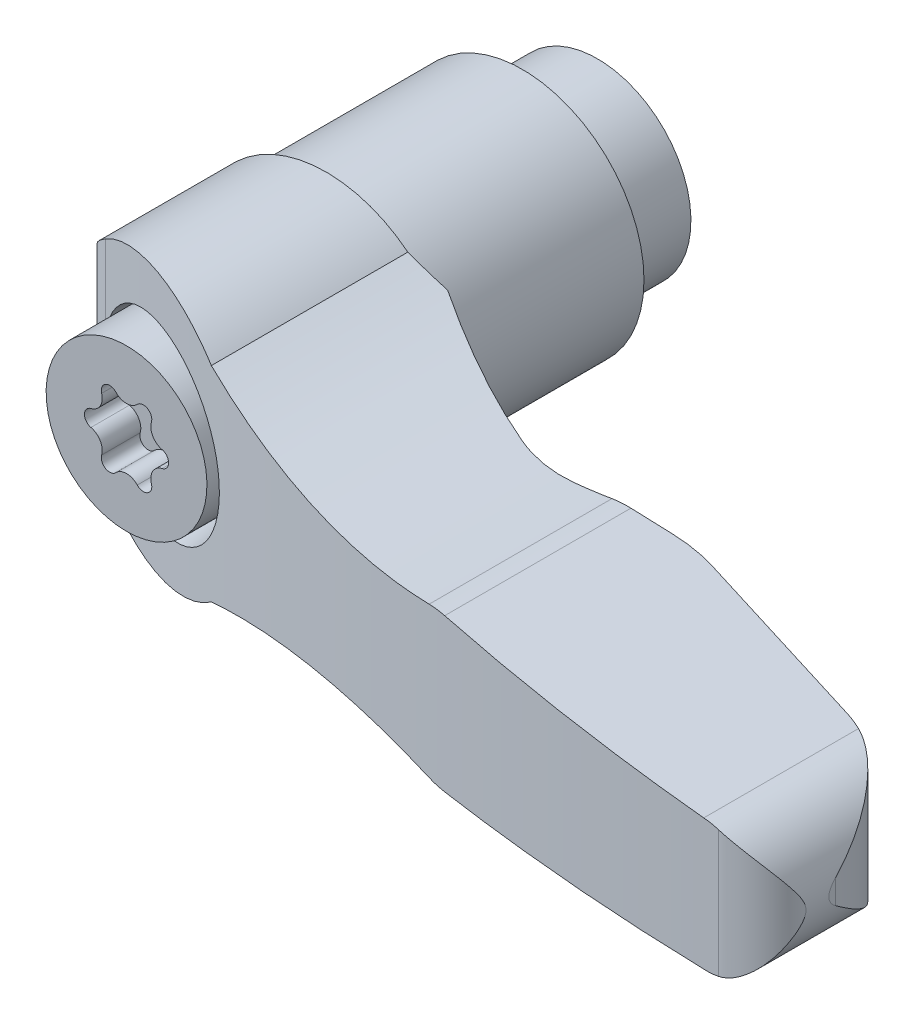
ISO-10303-21;
HEADER;
FILE_DESCRIPTION(('STEP AP214'),'2;1');
FILE_NAME('part.step','',(''),(''),'','','');
FILE_SCHEMA(('AUTOMOTIVE_DESIGN { 1 0 10303 214 1 1 1 1 }'));
ENDSEC;
DATA;
#1=APPLICATION_CONTEXT('core data for automotive mechanical design processes');
#2=APPLICATION_PROTOCOL_DEFINITION('international standard','automotive_design',2000,#1);
#3=PRODUCT_CONTEXT('',#1,'mechanical');
#4=PRODUCT('Part','Part','',(#3));
#5=PRODUCT_RELATED_PRODUCT_CATEGORY('part','',(#4));
#6=PRODUCT_DEFINITION_FORMATION('','',#4);
#7=PRODUCT_DEFINITION_CONTEXT('part definition',#1,'design');
#8=PRODUCT_DEFINITION('design','',#6,#7);
#9=PRODUCT_DEFINITION_SHAPE('','',#8);
#10=(LENGTH_UNIT() NAMED_UNIT(*) SI_UNIT(.MILLI.,.METRE.));
#11=(NAMED_UNIT(*) PLANE_ANGLE_UNIT() SI_UNIT($,.RADIAN.));
#12=(NAMED_UNIT(*) SI_UNIT($,.STERADIAN.) SOLID_ANGLE_UNIT());
#13=UNCERTAINTY_MEASURE_WITH_UNIT(LENGTH_MEASURE(1.E-05),#10,'distance_accuracy_value','');
#14=(GEOMETRIC_REPRESENTATION_CONTEXT(3) GLOBAL_UNCERTAINTY_ASSIGNED_CONTEXT((#13)) GLOBAL_UNIT_ASSIGNED_CONTEXT((#10,
#11,#12)) REPRESENTATION_CONTEXT('',''));
#15=CARTESIAN_POINT('',(0.,0.,0.));
#16=DIRECTION('',(0.,0.,1.));
#17=DIRECTION('',(1.,0.,0.));
#18=AXIS2_PLACEMENT_3D('',#15,#16,#17);
#19=CARTESIAN_POINT('',(5.,0.,0.));
#20=DIRECTION('',(0.,0.,-1.));
#21=DIRECTION('',(0.,1.,0.));
#22=AXIS2_PLACEMENT_3D('',#19,#20,#21);
#23=PLANE('',#22);
#24=CARTESIAN_POINT('',(0.,0.,0.));
#25=DIRECTION('',(0.,0.,-1.));
#26=DIRECTION('',(0.,1.,0.));
#27=AXIS2_PLACEMENT_3D('',#24,#25,#26);
#28=CIRCLE('',#27,2.95);
#29=CARTESIAN_POINT('',(0.,2.95,0.));
#30=VERTEX_POINT('',#29);
#31=EDGE_CURVE('E9',#30,#30,#28,.F.);
#32=ORIENTED_EDGE('',*,*,#31,.T.);
#33=EDGE_LOOP('',(#32));
#34=FACE_BOUND('',#33,.T.);
#35=CARTESIAN_POINT('',(0.,0.,0.));
#36=DIRECTION('',(0.,0.,1.));
#37=DIRECTION('',(0.,-1.,0.));
#38=AXIS2_PLACEMENT_3D('',#35,#36,#37);
#39=CIRCLE('',#38,5.);
#40=CARTESIAN_POINT('',(0.,-5.,0.));
#41=VERTEX_POINT('',#40);
#42=EDGE_CURVE('E705',#41,#41,#39,.T.);
#43=ORIENTED_EDGE('',*,*,#42,.F.);
#44=EDGE_LOOP('',(#43));
#45=FACE_BOUND('',#44,.T.);
#46=ADVANCED_FACE('F14',(#34,#45),#23,.T.);
#47=CARTESIAN_POINT('',(0.,0.,4.));
#48=DIRECTION('',(0.,0.,1.));
#49=DIRECTION('',(0.,-1.,0.));
#50=AXIS2_PLACEMENT_3D('',#47,#48,#49);
#51=CYLINDRICAL_SURFACE('',#50,5.);
#52=ORIENTED_EDGE('',*,*,#42,.T.);
#53=EDGE_LOOP('',(#52));
#54=FACE_BOUND('',#53,.T.);
#55=CARTESIAN_POINT('',(0.,0.,4.55));
#56=DIRECTION('',(0.,0.,1.));
#57=DIRECTION('',(0.,-1.,0.));
#58=AXIS2_PLACEMENT_3D('',#55,#56,#57);
#59=CIRCLE('',#58,5.);
#60=CARTESIAN_POINT('',(0.,-5.,4.55));
#61=VERTEX_POINT('',#60);
#62=EDGE_CURVE('E708',#61,#61,#59,.T.);
#63=ORIENTED_EDGE('',*,*,#62,.F.);
#64=EDGE_LOOP('',(#63));
#65=FACE_BOUND('',#64,.T.);
#66=ADVANCED_FACE('F650',(#54,#65),#51,.T.);
#67=CARTESIAN_POINT('',(-1.94278209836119,0.602050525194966,23.12));
#68=DIRECTION('',(0.,0.,-1.));
#69=DIRECTION('',(0.,1.,0.));
#70=AXIS2_PLACEMENT_3D('',#67,#68,#69);
#71=PLANE('',#70);
#72=CARTESIAN_POINT('',(-2.08556419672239,1.20410105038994,23.12));
#73=DIRECTION('',(0.,0.,-1.));
#74=DIRECTION('',(-1.,0.,0.));
#75=AXIS2_PLACEMENT_3D('',#72,#73,#74);
#76=CIRCLE('',#75,0.787499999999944);
#77=CARTESIAN_POINT('',(-1.3311142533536,1.42984766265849,23.12));
#78=VERTEX_POINT('',#77);
#79=CARTESIAN_POINT('',(-1.9038415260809,0.437854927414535,23.12));
#80=VERTEX_POINT('',#79);
#81=EDGE_CURVE('E734',#78,#80,#76,.T.);
#82=ORIENTED_EDGE('',*,*,#81,.T.);
#83=CARTESIAN_POINT('',(-1.8,0.,23.12));
#84=DIRECTION('',(0.,0.,1.));
#85=DIRECTION('',(1.,0.,0.));
#86=AXIS2_PLACEMENT_3D('',#83,#84,#85);
#87=CIRCLE('',#86,0.45);
#88=CARTESIAN_POINT('',(-1.9038415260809,-0.437854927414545,23.12));
#89=VERTEX_POINT('',#88);
#90=EDGE_CURVE('E735',#80,#89,#87,.T.);
#91=ORIENTED_EDGE('',*,*,#90,.T.);
#92=CARTESIAN_POINT('',(-2.08556419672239,-1.20410105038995,23.12));
#93=DIRECTION('',(0.,0.,-1.));
#94=DIRECTION('',(-1.,0.,0.));
#95=AXIS2_PLACEMENT_3D('',#92,#93,#94);
#96=CIRCLE('',#95,0.787499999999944);
#97=CARTESIAN_POINT('',(-1.3311142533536,-1.4298476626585,23.12));
#98=VERTEX_POINT('',#97);
#99=EDGE_CURVE('E739',#89,#98,#96,.T.);
#100=ORIENTED_EDGE('',*,*,#99,.T.);
#101=CARTESIAN_POINT('',(-0.899999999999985,-1.55884572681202,23.12));
#102=DIRECTION('',(0.,0.,1.));
#103=DIRECTION('',(1.,0.,0.));
#104=AXIS2_PLACEMENT_3D('',#101,#102,#103);
#105=CIRCLE('',#104,0.45);
#106=CARTESIAN_POINT('',(-0.57272727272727,-1.86770259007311,23.12));
#107=VERTEX_POINT('',#106);
#108=EDGE_CURVE('E743',#98,#107,#105,.T.);
#109=ORIENTED_EDGE('',*,*,#108,.T.);
#110=CARTESIAN_POINT('',(0.,-2.40820210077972,23.12));
#111=DIRECTION('',(0.,0.,-1.));
#112=DIRECTION('',(-1.,0.,0.));
#113=AXIS2_PLACEMENT_3D('',#110,#111,#112);
#114=CIRCLE('',#113,0.787499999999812);
#115=CARTESIAN_POINT('',(0.57272727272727,-1.86770259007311,23.12));
#116=VERTEX_POINT('',#115);
#117=EDGE_CURVE('E747',#107,#116,#114,.T.);
#118=ORIENTED_EDGE('',*,*,#117,.T.);
#119=CARTESIAN_POINT('',(0.899999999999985,-1.55884572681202,23.12));
#120=DIRECTION('',(0.,0.,1.));
#121=DIRECTION('',(-1.,0.,0.));
#122=AXIS2_PLACEMENT_3D('',#119,#120,#121);
#123=CIRCLE('',#122,0.45);
#124=CARTESIAN_POINT('',(1.3311142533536,-1.4298476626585,23.12));
#125=VERTEX_POINT('',#124);
#126=EDGE_CURVE('E751',#116,#125,#123,.T.);
#127=ORIENTED_EDGE('',*,*,#126,.T.);
#128=CARTESIAN_POINT('',(2.08556419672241,-1.20410105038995,23.12));
#129=DIRECTION('',(0.,0.,-1.));
#130=DIRECTION('',(1.,0.,0.));
#131=AXIS2_PLACEMENT_3D('',#128,#129,#130);
#132=CIRCLE('',#131,0.787499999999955);
#133=CARTESIAN_POINT('',(1.9038415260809,-0.437854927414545,23.12));
#134=VERTEX_POINT('',#133);
#135=EDGE_CURVE('E755',#125,#134,#132,.T.);
#136=ORIENTED_EDGE('',*,*,#135,.T.);
#137=CARTESIAN_POINT('',(1.8,0.,23.12));
#138=DIRECTION('',(0.,0.,1.));
#139=DIRECTION('',(-1.,0.,0.));
#140=AXIS2_PLACEMENT_3D('',#137,#138,#139);
#141=CIRCLE('',#140,0.45);
#142=CARTESIAN_POINT('',(1.9038415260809,0.437854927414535,23.12));
#143=VERTEX_POINT('',#142);
#144=EDGE_CURVE('E759',#134,#143,#141,.T.);
#145=ORIENTED_EDGE('',*,*,#144,.T.);
#146=CARTESIAN_POINT('',(2.08556419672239,1.20410105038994,23.12));
#147=DIRECTION('',(0.,0.,-1.));
#148=DIRECTION('',(1.,0.,0.));
#149=AXIS2_PLACEMENT_3D('',#146,#147,#148);
#150=CIRCLE('',#149,0.787499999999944);
#151=CARTESIAN_POINT('',(1.3311142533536,1.42984766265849,23.12));
#152=VERTEX_POINT('',#151);
#153=EDGE_CURVE('E763',#143,#152,#150,.T.);
#154=ORIENTED_EDGE('',*,*,#153,.T.);
#155=CARTESIAN_POINT('',(0.899999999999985,1.55884572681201,23.12));
#156=DIRECTION('',(0.,0.,1.));
#157=DIRECTION('',(-1.,0.,0.));
#158=AXIS2_PLACEMENT_3D('',#155,#156,#157);
#159=CIRCLE('',#158,0.45);
#160=CARTESIAN_POINT('',(0.57272727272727,1.8677025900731,23.12));
#161=VERTEX_POINT('',#160);
#162=EDGE_CURVE('E767',#152,#161,#159,.T.);
#163=ORIENTED_EDGE('',*,*,#162,.T.);
#164=CARTESIAN_POINT('',(0.,2.40820210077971,23.12));
#165=DIRECTION('',(0.,0.,-1.));
#166=DIRECTION('',(-1.,0.,0.));
#167=AXIS2_PLACEMENT_3D('',#164,#165,#166);
#168=CIRCLE('',#167,0.787499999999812);
#169=CARTESIAN_POINT('',(-0.57272727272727,1.8677025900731,23.12));
#170=VERTEX_POINT('',#169);
#171=EDGE_CURVE('E771',#161,#170,#168,.T.);
#172=ORIENTED_EDGE('',*,*,#171,.T.);
#173=CARTESIAN_POINT('',(-0.899999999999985,1.55884572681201,23.12));
#174=DIRECTION('',(0.,0.,1.));
#175=DIRECTION('',(1.,0.,0.));
#176=AXIS2_PLACEMENT_3D('',#173,#174,#175);
#177=CIRCLE('',#176,0.45);
#178=EDGE_CURVE('E775',#170,#78,#177,.T.);
#179=ORIENTED_EDGE('',*,*,#178,.T.);
#180=EDGE_LOOP('',(#82,#91,#100,#109,#118,#127,#136,#145,#154,#163,#172,#179));
#181=FACE_BOUND('',#180,.T.);
#182=ADVANCED_FACE('F646',(#181),#71,.F.);
#183=CARTESIAN_POINT('',(-2.08556419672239,-1.20410105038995,27.24));
#184=DIRECTION('',(0.,0.,-1.));
#185=DIRECTION('',(0.,1.,0.));
#186=AXIS2_PLACEMENT_3D('',#183,#184,#185);
#187=CYLINDRICAL_SURFACE('',#186,0.787499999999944);
#188=DIRECTION('',(0.,0.,-1.));
#189=VECTOR('',#188,1.);
#190=CARTESIAN_POINT('',(-1.3311142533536,-1.42984766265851,27.24));
#191=LINE('',#190,#189);
#192=CARTESIAN_POINT('',(-1.3311142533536,-1.42984766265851,25.18));
#193=VERTEX_POINT('',#192);
#194=EDGE_CURVE('E799',#193,#98,#191,.T.);
#195=ORIENTED_EDGE('',*,*,#194,.T.);
#196=ORIENTED_EDGE('',*,*,#99,.F.);
#197=DIRECTION('',(0.,0.,-1.));
#198=VECTOR('',#197,1.);
#199=CARTESIAN_POINT('',(-1.9038415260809,-0.437854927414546,27.24));
#200=LINE('',#199,#198);
#201=CARTESIAN_POINT('',(-1.9038415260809,-0.437854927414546,25.18));
#202=VERTEX_POINT('',#201);
#203=EDGE_CURVE('E801',#202,#89,#200,.T.);
#204=ORIENTED_EDGE('',*,*,#203,.F.);
#205=CARTESIAN_POINT('',(-2.08556419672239,-1.20410105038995,25.18));
#206=DIRECTION('',(0.,0.,1.));
#207=DIRECTION('',(0.,-1.,0.));
#208=AXIS2_PLACEMENT_3D('',#205,#206,#207);
#209=CIRCLE('',#208,0.787499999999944);
#210=EDGE_CURVE('E836',#193,#202,#209,.T.);
#211=ORIENTED_EDGE('',*,*,#210,.F.);
#212=EDGE_LOOP('',(#195,#196,#204,#211));
#213=FACE_BOUND('',#212,.T.);
#214=ADVANCED_FACE('F649',(#213),#187,.T.);
#215=CARTESIAN_POINT('',(-0.899999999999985,-1.55884572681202,27.24));
#216=DIRECTION('',(0.,0.,-1.));
#217=DIRECTION('',(0.,1.,0.));
#218=AXIS2_PLACEMENT_3D('',#215,#216,#217);
#219=CYLINDRICAL_SURFACE('',#218,0.45);
#220=DIRECTION('',(0.,0.,-1.));
#221=VECTOR('',#220,1.);
#222=CARTESIAN_POINT('',(-0.57272727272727,-1.86770259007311,27.24));
#223=LINE('',#222,#221);
#224=CARTESIAN_POINT('',(-0.57272727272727,-1.86770259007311,25.18));
#225=VERTEX_POINT('',#224);
#226=EDGE_CURVE('E797',#225,#107,#223,.T.);
#227=ORIENTED_EDGE('',*,*,#226,.T.);
#228=ORIENTED_EDGE('',*,*,#108,.F.);
#229=ORIENTED_EDGE('',*,*,#194,.F.);
#230=CARTESIAN_POINT('',(-0.899999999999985,-1.55884572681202,25.18));
#231=DIRECTION('',(0.,0.,1.));
#232=DIRECTION('',(0.,-1.,0.));
#233=AXIS2_PLACEMENT_3D('',#230,#231,#232);
#234=CIRCLE('',#233,0.45);
#235=EDGE_CURVE('E833',#225,#193,#234,.F.);
#236=ORIENTED_EDGE('',*,*,#235,.F.);
#237=EDGE_LOOP('',(#227,#228,#229,#236));
#238=FACE_BOUND('',#237,.T.);
#239=ADVANCED_FACE('F683',(#238),#219,.F.);
#240=CARTESIAN_POINT('',(0.,-2.40820210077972,27.24));
#241=DIRECTION('',(0.,0.,-1.));
#242=DIRECTION('',(0.,1.,0.));
#243=AXIS2_PLACEMENT_3D('',#240,#241,#242);
#244=CYLINDRICAL_SURFACE('',#243,0.787499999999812);
#245=DIRECTION('',(0.,0.,-1.));
#246=VECTOR('',#245,1.);
#247=CARTESIAN_POINT('',(0.57272727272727,-1.86770259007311,27.24));
#248=LINE('',#247,#246);
#249=CARTESIAN_POINT('',(0.57272727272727,-1.86770259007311,25.18));
#250=VERTEX_POINT('',#249);
#251=EDGE_CURVE('E795',#250,#116,#248,.T.);
#252=ORIENTED_EDGE('',*,*,#251,.T.);
#253=ORIENTED_EDGE('',*,*,#117,.F.);
#254=ORIENTED_EDGE('',*,*,#226,.F.);
#255=CARTESIAN_POINT('',(0.,-2.40820210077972,25.18));
#256=DIRECTION('',(0.,0.,1.));
#257=DIRECTION('',(0.,-1.,0.));
#258=AXIS2_PLACEMENT_3D('',#255,#256,#257);
#259=CIRCLE('',#258,0.787499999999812);
#260=EDGE_CURVE('E830',#250,#225,#259,.T.);
#261=ORIENTED_EDGE('',*,*,#260,.F.);
#262=EDGE_LOOP('',(#252,#253,#254,#261));
#263=FACE_BOUND('',#262,.T.);
#264=ADVANCED_FACE('F679',(#263),#244,.T.);
#265=CARTESIAN_POINT('',(0.899999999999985,-1.55884572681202,27.24));
#266=DIRECTION('',(0.,0.,-1.));
#267=DIRECTION('',(0.,1.,0.));
#268=AXIS2_PLACEMENT_3D('',#265,#266,#267);
#269=CYLINDRICAL_SURFACE('',#268,0.45);
#270=DIRECTION('',(0.,0.,-1.));
#271=VECTOR('',#270,1.);
#272=CARTESIAN_POINT('',(1.3311142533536,-1.42984766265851,27.24));
#273=LINE('',#272,#271);
#274=CARTESIAN_POINT('',(1.3311142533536,-1.42984766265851,25.18));
#275=VERTEX_POINT('',#274);
#276=EDGE_CURVE('E793',#275,#125,#273,.T.);
#277=ORIENTED_EDGE('',*,*,#276,.T.);
#278=ORIENTED_EDGE('',*,*,#126,.F.);
#279=ORIENTED_EDGE('',*,*,#251,.F.);
#280=CARTESIAN_POINT('',(0.899999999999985,-1.55884572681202,25.18));
#281=DIRECTION('',(0.,0.,1.));
#282=DIRECTION('',(0.,-1.,0.));
#283=AXIS2_PLACEMENT_3D('',#280,#281,#282);
#284=CIRCLE('',#283,0.45);
#285=EDGE_CURVE('E827',#275,#250,#284,.F.);
#286=ORIENTED_EDGE('',*,*,#285,.F.);
#287=EDGE_LOOP('',(#277,#278,#279,#286));
#288=FACE_BOUND('',#287,.T.);
#289=ADVANCED_FACE('F675',(#288),#269,.F.);
#290=CARTESIAN_POINT('',(2.08556419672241,-1.20410105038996,27.24));
#291=DIRECTION('',(0.,0.,-1.));
#292=DIRECTION('',(0.,1.,0.));
#293=AXIS2_PLACEMENT_3D('',#290,#291,#292);
#294=CYLINDRICAL_SURFACE('',#293,0.787499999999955);
#295=DIRECTION('',(0.,0.,-1.));
#296=VECTOR('',#295,1.);
#297=CARTESIAN_POINT('',(1.9038415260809,-0.437854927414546,27.24));
#298=LINE('',#297,#296);
#299=CARTESIAN_POINT('',(1.9038415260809,-0.437854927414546,25.18));
#300=VERTEX_POINT('',#299);
#301=EDGE_CURVE('E791',#300,#134,#298,.T.);
#302=ORIENTED_EDGE('',*,*,#301,.T.);
#303=ORIENTED_EDGE('',*,*,#135,.F.);
#304=ORIENTED_EDGE('',*,*,#276,.F.);
#305=CARTESIAN_POINT('',(2.08556419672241,-1.20410105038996,25.18));
#306=DIRECTION('',(0.,0.,1.));
#307=DIRECTION('',(0.,-1.,0.));
#308=AXIS2_PLACEMENT_3D('',#305,#306,#307);
#309=CIRCLE('',#308,0.787499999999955);
#310=EDGE_CURVE('E824',#300,#275,#309,.T.);
#311=ORIENTED_EDGE('',*,*,#310,.F.);
#312=EDGE_LOOP('',(#302,#303,#304,#311));
#313=FACE_BOUND('',#312,.T.);
#314=ADVANCED_FACE('F671',(#313),#294,.T.);
#315=CARTESIAN_POINT('',(1.8,0.,27.24));
#316=DIRECTION('',(0.,0.,-1.));
#317=DIRECTION('',(0.,1.,0.));
#318=AXIS2_PLACEMENT_3D('',#315,#316,#317);
#319=CYLINDRICAL_SURFACE('',#318,0.45);
#320=DIRECTION('',(0.,0.,-1.));
#321=VECTOR('',#320,1.);
#322=CARTESIAN_POINT('',(1.9038415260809,0.437854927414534,27.24));
#323=LINE('',#322,#321);
#324=CARTESIAN_POINT('',(1.9038415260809,0.437854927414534,25.18));
#325=VERTEX_POINT('',#324);
#326=EDGE_CURVE('E789',#325,#143,#323,.T.);
#327=ORIENTED_EDGE('',*,*,#326,.T.);
#328=ORIENTED_EDGE('',*,*,#144,.F.);
#329=ORIENTED_EDGE('',*,*,#301,.F.);
#330=CARTESIAN_POINT('',(1.8,0.,25.18));
#331=DIRECTION('',(0.,0.,1.));
#332=DIRECTION('',(0.,-1.,0.));
#333=AXIS2_PLACEMENT_3D('',#330,#331,#332);
#334=CIRCLE('',#333,0.45);
#335=EDGE_CURVE('E821',#325,#300,#334,.F.);
#336=ORIENTED_EDGE('',*,*,#335,.F.);
#337=EDGE_LOOP('',(#327,#328,#329,#336));
#338=FACE_BOUND('',#337,.T.);
#339=ADVANCED_FACE('F667',(#338),#319,.F.);
#340=CARTESIAN_POINT('',(2.08556419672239,1.20410105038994,27.24));
#341=DIRECTION('',(0.,0.,-1.));
#342=DIRECTION('',(0.,1.,0.));
#343=AXIS2_PLACEMENT_3D('',#340,#341,#342);
#344=CYLINDRICAL_SURFACE('',#343,0.787499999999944);
#345=DIRECTION('',(0.,0.,-1.));
#346=VECTOR('',#345,1.);
#347=CARTESIAN_POINT('',(1.3311142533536,1.42984766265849,27.24));
#348=LINE('',#347,#346);
#349=CARTESIAN_POINT('',(1.3311142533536,1.42984766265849,25.18));
#350=VERTEX_POINT('',#349);
#351=EDGE_CURVE('E787',#350,#152,#348,.T.);
#352=ORIENTED_EDGE('',*,*,#351,.T.);
#353=ORIENTED_EDGE('',*,*,#153,.F.);
#354=ORIENTED_EDGE('',*,*,#326,.F.);
#355=CARTESIAN_POINT('',(2.08556419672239,1.20410105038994,25.18));
#356=DIRECTION('',(0.,0.,1.));
#357=DIRECTION('',(0.,-1.,0.));
#358=AXIS2_PLACEMENT_3D('',#355,#356,#357);
#359=CIRCLE('',#358,0.787499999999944);
#360=EDGE_CURVE('E818',#350,#325,#359,.T.);
#361=ORIENTED_EDGE('',*,*,#360,.F.);
#362=EDGE_LOOP('',(#352,#353,#354,#361));
#363=FACE_BOUND('',#362,.T.);
#364=ADVANCED_FACE('F663',(#363),#344,.T.);
#365=CARTESIAN_POINT('',(0.899999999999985,1.55884572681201,27.24));
#366=DIRECTION('',(0.,0.,-1.));
#367=DIRECTION('',(0.,1.,0.));
#368=AXIS2_PLACEMENT_3D('',#365,#366,#367);
#369=CYLINDRICAL_SURFACE('',#368,0.45);
#370=DIRECTION('',(0.,0.,-1.));
#371=VECTOR('',#370,1.);
#372=CARTESIAN_POINT('',(0.57272727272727,1.8677025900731,27.24));
#373=LINE('',#372,#371);
#374=CARTESIAN_POINT('',(0.57272727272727,1.8677025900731,25.18));
#375=VERTEX_POINT('',#374);
#376=EDGE_CURVE('E785',#375,#161,#373,.T.);
#377=ORIENTED_EDGE('',*,*,#376,.T.);
#378=ORIENTED_EDGE('',*,*,#162,.F.);
#379=ORIENTED_EDGE('',*,*,#351,.F.);
#380=CARTESIAN_POINT('',(0.899999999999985,1.55884572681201,25.18));
#381=DIRECTION('',(0.,0.,1.));
#382=DIRECTION('',(0.,-1.,0.));
#383=AXIS2_PLACEMENT_3D('',#380,#381,#382);
#384=CIRCLE('',#383,0.45);
#385=EDGE_CURVE('E815',#375,#350,#384,.F.);
#386=ORIENTED_EDGE('',*,*,#385,.F.);
#387=EDGE_LOOP('',(#377,#378,#379,#386));
#388=FACE_BOUND('',#387,.T.);
#389=ADVANCED_FACE('F659',(#388),#369,.F.);
#390=CARTESIAN_POINT('',(0.,2.40820210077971,27.24));
#391=DIRECTION('',(0.,0.,-1.));
#392=DIRECTION('',(0.,1.,0.));
#393=AXIS2_PLACEMENT_3D('',#390,#391,#392);
#394=CYLINDRICAL_SURFACE('',#393,0.787499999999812);
#395=DIRECTION('',(0.,0.,-1.));
#396=VECTOR('',#395,1.);
#397=CARTESIAN_POINT('',(-0.57272727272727,1.8677025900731,27.24));
#398=LINE('',#397,#396);
#399=CARTESIAN_POINT('',(-0.57272727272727,1.8677025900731,25.18));
#400=VERTEX_POINT('',#399);
#401=EDGE_CURVE('E113',#400,#170,#398,.T.);
#402=ORIENTED_EDGE('',*,*,#401,.T.);
#403=ORIENTED_EDGE('',*,*,#171,.F.);
#404=ORIENTED_EDGE('',*,*,#376,.F.);
#405=CARTESIAN_POINT('',(0.,2.40820210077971,25.18));
#406=DIRECTION('',(0.,0.,1.));
#407=DIRECTION('',(0.,-1.,0.));
#408=AXIS2_PLACEMENT_3D('',#405,#406,#407);
#409=CIRCLE('',#408,0.787499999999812);
#410=EDGE_CURVE('E812',#400,#375,#409,.T.);
#411=ORIENTED_EDGE('',*,*,#410,.F.);
#412=EDGE_LOOP('',(#402,#403,#404,#411));
#413=FACE_BOUND('',#412,.T.);
#414=ADVANCED_FACE('F656',(#413),#394,.T.);
#415=CARTESIAN_POINT('',(-0.899999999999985,1.55884572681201,27.24));
#416=DIRECTION('',(0.,0.,-1.));
#417=DIRECTION('',(0.,1.,0.));
#418=AXIS2_PLACEMENT_3D('',#415,#416,#417);
#419=CYLINDRICAL_SURFACE('',#418,0.45);
#420=DIRECTION('',(0.,0.,-1.));
#421=VECTOR('',#420,1.);
#422=CARTESIAN_POINT('',(-1.3311142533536,1.42984766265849,27.24));
#423=LINE('',#422,#421);
#424=CARTESIAN_POINT('',(-1.3311142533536,1.42984766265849,25.18));
#425=VERTEX_POINT('',#424);
#426=EDGE_CURVE('E779',#425,#78,#423,.T.);
#427=ORIENTED_EDGE('',*,*,#426,.T.);
#428=ORIENTED_EDGE('',*,*,#178,.F.);
#429=ORIENTED_EDGE('',*,*,#401,.F.);
#430=CARTESIAN_POINT('',(-0.899999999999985,1.55884572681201,25.18));
#431=DIRECTION('',(0.,0.,1.));
#432=DIRECTION('',(0.,-1.,0.));
#433=AXIS2_PLACEMENT_3D('',#430,#431,#432);
#434=CIRCLE('',#433,0.45);
#435=EDGE_CURVE('E809',#425,#400,#434,.F.);
#436=ORIENTED_EDGE('',*,*,#435,.F.);
#437=EDGE_LOOP('',(#427,#428,#429,#436));
#438=FACE_BOUND('',#437,.T.);
#439=ADVANCED_FACE('F652',(#438),#419,.F.);
#440=CARTESIAN_POINT('',(-2.08556419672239,1.20410105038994,27.24));
#441=DIRECTION('',(0.,0.,-1.));
#442=DIRECTION('',(0.,1.,0.));
#443=AXIS2_PLACEMENT_3D('',#440,#441,#442);
#444=CYLINDRICAL_SURFACE('',#443,0.787499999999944);
#445=DIRECTION('',(0.,0.,-1.));
#446=VECTOR('',#445,1.);
#447=CARTESIAN_POINT('',(-1.9038415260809,0.437854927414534,27.24));
#448=LINE('',#447,#446);
#449=CARTESIAN_POINT('',(-1.9038415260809,0.437854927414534,25.18));
#450=VERTEX_POINT('',#449);
#451=EDGE_CURVE('E803',#450,#80,#448,.T.);
#452=ORIENTED_EDGE('',*,*,#451,.T.);
#453=ORIENTED_EDGE('',*,*,#81,.F.);
#454=ORIENTED_EDGE('',*,*,#426,.F.);
#455=CARTESIAN_POINT('',(-2.08556419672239,1.20410105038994,25.18));
#456=DIRECTION('',(0.,0.,1.));
#457=DIRECTION('',(0.,-1.,0.));
#458=AXIS2_PLACEMENT_3D('',#455,#456,#457);
#459=CIRCLE('',#458,0.787499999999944);
#460=EDGE_CURVE('E107',#450,#425,#459,.T.);
#461=ORIENTED_EDGE('',*,*,#460,.F.);
#462=EDGE_LOOP('',(#452,#453,#454,#461));
#463=FACE_BOUND('',#462,.T.);
#464=ADVANCED_FACE('F655',(#463),#444,.T.);
#465=CARTESIAN_POINT('',(-1.8,0.,27.24));
#466=DIRECTION('',(0.,0.,-1.));
#467=DIRECTION('',(0.,1.,0.));
#468=AXIS2_PLACEMENT_3D('',#465,#466,#467);
#469=CYLINDRICAL_SURFACE('',#468,0.45);
#470=ORIENTED_EDGE('',*,*,#203,.T.);
#471=ORIENTED_EDGE('',*,*,#90,.F.);
#472=ORIENTED_EDGE('',*,*,#451,.F.);
#473=CARTESIAN_POINT('',(-1.8,0.,25.18));
#474=DIRECTION('',(0.,0.,1.));
#475=DIRECTION('',(0.,-1.,0.));
#476=AXIS2_PLACEMENT_3D('',#473,#474,#475);
#477=CIRCLE('',#476,0.45);
#478=EDGE_CURVE('E839',#202,#450,#477,.F.);
#479=ORIENTED_EDGE('',*,*,#478,.F.);
#480=EDGE_LOOP('',(#470,#471,#472,#479));
#481=FACE_BOUND('',#480,.T.);
#482=ADVANCED_FACE('F624',(#481),#469,.F.);
#483=CARTESIAN_POINT('',(0.,0.,25.18));
#484=DIRECTION('',(0.,0.,1.));
#485=DIRECTION('',(0.,-1.,0.));
#486=AXIS2_PLACEMENT_3D('',#483,#484,#485);
#487=PLANE('',#486);
#488=CARTESIAN_POINT('',(0.,0.,25.18));
#489=DIRECTION('',(0.,0.,1.));
#490=DIRECTION('',(0.,-1.,0.));
#491=AXIS2_PLACEMENT_3D('',#488,#489,#490);
#492=CIRCLE('',#491,4.3);
#493=CARTESIAN_POINT('',(0.,-4.30000000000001,25.18));
#494=VERTEX_POINT('',#493);
#495=EDGE_CURVE('E806',#494,#494,#492,.T.);
#496=ORIENTED_EDGE('',*,*,#495,.T.);
#497=EDGE_LOOP('',(#496));
#498=FACE_BOUND('',#497,.T.);
#499=ORIENTED_EDGE('',*,*,#478,.T.);
#500=ORIENTED_EDGE('',*,*,#460,.T.);
#501=ORIENTED_EDGE('',*,*,#435,.T.);
#502=ORIENTED_EDGE('',*,*,#410,.T.);
#503=ORIENTED_EDGE('',*,*,#385,.T.);
#504=ORIENTED_EDGE('',*,*,#360,.T.);
#505=ORIENTED_EDGE('',*,*,#335,.T.);
#506=ORIENTED_EDGE('',*,*,#310,.T.);
#507=ORIENTED_EDGE('',*,*,#285,.T.);
#508=ORIENTED_EDGE('',*,*,#260,.T.);
#509=ORIENTED_EDGE('',*,*,#235,.T.);
#510=ORIENTED_EDGE('',*,*,#210,.T.);
#511=EDGE_LOOP('',(#499,#500,#501,#502,#503,#504,#505,#506,#507,#508,#509,#510));
#512=FACE_BOUND('',#511,.T.);
#513=ADVANCED_FACE('F617',(#498,#512),#487,.T.);
#514=CARTESIAN_POINT('',(0.,0.,4.));
#515=DIRECTION('',(0.,0.,1.));
#516=DIRECTION('',(0.,-1.,0.));
#517=AXIS2_PLACEMENT_3D('',#514,#515,#516);
#518=CYLINDRICAL_SURFACE('',#517,4.3);
#519=CARTESIAN_POINT('',(0.,0.,21.34));
#520=DIRECTION('',(0.,0.,1.));
#521=DIRECTION('',(0.,-1.,0.));
#522=AXIS2_PLACEMENT_3D('',#519,#520,#521);
#523=CIRCLE('',#522,4.3);
#524=CARTESIAN_POINT('',(0.,-4.3,21.34));
#525=VERTEX_POINT('',#524);
#526=EDGE_CURVE('E710',#525,#525,#523,.T.);
#527=ORIENTED_EDGE('',*,*,#526,.T.);
#528=EDGE_LOOP('',(#527));
#529=FACE_BOUND('',#528,.T.);
#530=ORIENTED_EDGE('',*,*,#495,.F.);
#531=EDGE_LOOP('',(#530));
#532=FACE_BOUND('',#531,.T.);
#533=ADVANCED_FACE('F612',(#529,#532),#518,.T.);
#534=CARTESIAN_POINT('',(39.938965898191,-8.,27.204249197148));
#535=DIRECTION('',(-0.989626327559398,0.,0.143665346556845));
#536=DIRECTION('',(-0.143665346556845,0.,-0.989626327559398));
#537=AXIS2_PLACEMENT_3D('',#534,#535,#536);
#538=PLANE('',#537);
#539=CARTESIAN_POINT('',(36.5,0.,3.51522972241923));
#540=DIRECTION('',(-0.989626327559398,0.,0.143665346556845));
#541=DIRECTION('',(0.143665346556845,0.,0.989626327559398));
#542=AXIS2_PLACEMENT_3D('',#539,#540,#541);
#543=ELLIPSE('',#542,24.3621728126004,3.5);
#544=CARTESIAN_POINT('',(39.938965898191,-0.650779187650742,27.204249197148));
#545=VERTEX_POINT('',#544);
#546=CARTESIAN_POINT('',(39.938965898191,0.650779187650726,27.204249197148));
#547=VERTEX_POINT('',#546);
#548=EDGE_CURVE('E440',#545,#547,#543,.T.);
#549=ORIENTED_EDGE('',*,*,#548,.F.);
#550=DIRECTION('',(0.,1.,0.));
#551=VECTOR('',#550,1.);
#552=CARTESIAN_POINT('',(39.938965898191,-8.,27.204249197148));
#553=LINE('',#552,#551);
#554=EDGE_CURVE('E283',#545,#547,#553,.T.);
#555=ORIENTED_EDGE('',*,*,#554,.T.);
#556=EDGE_LOOP('',(#549,#555));
#557=FACE_BOUND('',#556,.T.);
#558=ADVANCED_FACE('F451',(#557),#538,.F.);
#559=CARTESIAN_POINT('',(33.8626602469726,-8.,28.0863544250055));
#560=DIRECTION('',(0.,1.,0.));
#561=DIRECTION('',(-1.,0.,0.));
#562=AXIS2_PLACEMENT_3D('',#559,#560,#561);
#563=CYLINDRICAL_SURFACE('',#562,6.14000000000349);
#564=CARTESIAN_POINT('',(33.8626602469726,3.59762871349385,28.0863544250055));
#565=DIRECTION('',(0.0369925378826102,0.999315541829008,0.));
#566=DIRECTION('',(-0.999315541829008,0.0369925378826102,0.));
#567=AXIS2_PLACEMENT_3D('',#564,#565,#566);
#568=ELLIPSE('',#567,6.14420545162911,6.14000000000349);
#569=CARTESIAN_POINT('',(36.5,3.5,22.5416236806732));
#570=VERTEX_POINT('',#569);
#571=CARTESIAN_POINT('',(35.534460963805,3.53574220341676,22.178335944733));
#572=VERTEX_POINT('',#571);
#573=EDGE_CURVE('E610',#570,#572,#568,.T.);
#574=ORIENTED_EDGE('',*,*,#573,.F.);
#575=CARTESIAN_POINT('',(39.938965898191,0.650779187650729,27.204249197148));
#576=CARTESIAN_POINT('',(39.9247028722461,0.7260863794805,27.1059853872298));
#577=CARTESIAN_POINT('',(39.9079968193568,0.800887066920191,27.007686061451));
#578=CARTESIAN_POINT('',(39.8696347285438,0.949458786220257,26.8112602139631));
#579=CARTESIAN_POINT('',(39.8479781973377,1.02322971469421,26.7131337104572));
#580=CARTESIAN_POINT('',(39.7995979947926,1.16988012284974,26.5170899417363));
#581=CARTESIAN_POINT('',(39.7728626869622,1.24275713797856,26.4191736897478));
#582=CARTESIAN_POINT('',(39.7142815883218,1.3872541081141,26.2239599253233));
#583=CARTESIAN_POINT('',(39.6824358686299,1.45887408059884,26.1266624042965));
#584=CARTESIAN_POINT('',(39.5782917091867,1.67318502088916,25.8337016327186));
#585=CARTESIAN_POINT('',(39.4979263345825,1.81366367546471,25.6391889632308));
#586=CARTESIAN_POINT('',(39.3150854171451,2.08619457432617,25.2551202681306));
#587=CARTESIAN_POINT('',(39.2126344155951,2.21825596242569,25.0655590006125));
#588=CARTESIAN_POINT('',(38.9595027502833,2.49877334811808,24.6523338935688));
#589=CARTESIAN_POINT('',(38.8031801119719,2.64456339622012,24.4302018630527));
#590=CARTESIAN_POINT('',(38.5417124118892,2.84488994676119,24.108275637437));
#591=CARTESIAN_POINT('',(38.4501831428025,2.90854134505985,24.0029632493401));
#592=CARTESIAN_POINT('',(38.2579442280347,3.02861213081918,23.7967186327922));
#593=CARTESIAN_POINT('',(38.1572360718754,3.08503268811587,23.6957856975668));
#594=CARTESIAN_POINT('',(37.8892625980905,3.21757634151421,23.4457323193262));
#595=CARTESIAN_POINT('',(37.7155213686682,3.28779061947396,23.3001643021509));
#596=CARTESIAN_POINT('',(37.4396992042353,3.37286339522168,23.0946053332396));
#597=CARTESIAN_POINT('',(37.3453175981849,3.39783246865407,23.0282732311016));
#598=CARTESIAN_POINT('',(37.1517842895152,3.44019984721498,22.9003457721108));
#599=CARTESIAN_POINT('',(37.0526354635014,3.45760265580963,22.8387476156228));
#600=CARTESIAN_POINT('',(36.8781783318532,3.48029211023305,22.7372021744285));
#601=CARTESIAN_POINT('',(36.8038676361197,3.48759914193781,22.6959814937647));
#602=CARTESIAN_POINT('',(36.6533047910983,3.49745586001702,22.6165121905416));
#603=CARTESIAN_POINT('',(36.5770513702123,3.50000234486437,22.57826558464));
#604=CARTESIAN_POINT('',(36.5,3.5,22.5416236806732));
#605=B_SPLINE_CURVE_WITH_KNOTS('',3,(#575,#576,#577,#578,#579,#580,#581,#582,#583,#584,#585,
#586,#587,#588,#589,#590,#591,#592,#593,#594,#595,#596,#597,#598,#599,#600,#601,#602,#603,#604),
.UNSPECIFIED.,.F.,.F.,(4,2,2,2,2,2,2,2,2,2,2,2,2,2,4),(0.,0.373839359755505,0.747715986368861,
1.1224598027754,1.49719840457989,2.25512351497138,3.01221072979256,3.93367725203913,
4.39332639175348,4.85290107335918,5.56171222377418,5.91546495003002,6.26900683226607,
6.52468766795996,6.78054039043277),.UNSPECIFIED.);
#606=EDGE_CURVE('E439',#547,#570,#605,.T.);
#607=ORIENTED_EDGE('',*,*,#606,.F.);
#608=ORIENTED_EDGE('',*,*,#554,.F.);
#609=CARTESIAN_POINT('',(36.5,-3.5,22.5416236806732));
#610=CARTESIAN_POINT('',(36.6061539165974,-3.50000941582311,22.5920863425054));
#611=CARTESIAN_POINT('',(36.7107657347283,-3.49517280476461,22.6456099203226));
#612=CARTESIAN_POINT('',(36.9160027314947,-3.47671082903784,22.7581011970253));
#613=CARTESIAN_POINT('',(37.016634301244,-3.46310021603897,22.8170596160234));
#614=CARTESIAN_POINT('',(37.212347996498,-3.42816986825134,22.9392782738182));
#615=CARTESIAN_POINT('',(37.3074768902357,-3.40693163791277,23.0024874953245));
#616=CARTESIAN_POINT('',(37.4929223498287,-3.35757592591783,23.1332068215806));
#617=CARTESIAN_POINT('',(37.5832363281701,-3.32945478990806,23.2007191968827));
#618=CARTESIAN_POINT('',(37.7830795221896,-3.25850520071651,23.3587409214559));
#619=CARTESIAN_POINT('',(37.8909927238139,-3.21376078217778,23.4504360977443));
#620=CARTESIAN_POINT('',(38.0982482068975,-3.11588681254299,23.6389903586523));
#621=CARTESIAN_POINT('',(38.1975840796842,-3.06275107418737,23.7358532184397));
#622=CARTESIAN_POINT('',(38.3880468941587,-2.94917464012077,23.934309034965));
#623=CARTESIAN_POINT('',(38.4791322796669,-2.88870020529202,24.035922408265));
#624=CARTESIAN_POINT('',(38.6526412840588,-2.76182607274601,24.2426721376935));
#625=CARTESIAN_POINT('',(38.7350674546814,-2.69542813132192,24.3478074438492));
#626=CARTESIAN_POINT('',(38.9229341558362,-2.52996933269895,24.6038856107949));
#627=CARTESIAN_POINT('',(39.0243159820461,-2.42850340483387,24.7562617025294));
#628=CARTESIAN_POINT('',(39.2111706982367,-2.21796613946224,25.0654781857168));
#629=CARTESIAN_POINT('',(39.2966363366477,-2.10889136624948,25.2223205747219));
#630=CARTESIAN_POINT('',(39.4522229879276,-1.88493092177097,25.5392893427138));
#631=CARTESIAN_POINT('',(39.5223498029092,-1.77004746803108,25.6994144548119));
#632=CARTESIAN_POINT('',(39.6478320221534,-1.53583460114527,26.0220530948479));
#633=CARTESIAN_POINT('',(39.7031929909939,-1.41650688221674,26.1845656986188));
#634=CARTESIAN_POINT('',(39.7933776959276,-1.19018579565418,26.4900634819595));
#635=CARTESIAN_POINT('',(39.8299343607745,-1.08360162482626,26.6328455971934));
#636=CARTESIAN_POINT('',(39.8923391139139,-0.868586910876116,26.9185049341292));
#637=CARTESIAN_POINT('',(39.9182264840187,-0.760164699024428,27.0613798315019));
#638=CARTESIAN_POINT('',(39.938965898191,-0.650779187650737,27.204249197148));
#639=B_SPLINE_CURVE_WITH_KNOTS('',3,(#609,#610,#611,#612,#613,#614,#615,#616,#617,#618,#619,
#620,#621,#622,#623,#624,#625,#626,#627,#628,#629,#630,#631,#632,#633,#634,#635,#636,#637,#638),
.UNSPECIFIED.,.F.,.F.,(4,2,2,2,2,2,2,2,2,2,2,2,2,2,4),(0.,0.352350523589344,0.704110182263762,
1.05221781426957,1.40051067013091,1.84538152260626,2.29058194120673,2.73791274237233,
3.18511134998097,3.81198117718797,4.43913591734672,5.06605301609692,5.69273352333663,
6.23807905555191,6.78139842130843),.UNSPECIFIED.);
#640=CARTESIAN_POINT('',(36.5,-3.5,22.5416236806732));
#641=VERTEX_POINT('',#640);
#642=EDGE_CURVE('E433',#641,#545,#639,.T.);
#643=ORIENTED_EDGE('',*,*,#642,.F.);
#644=CARTESIAN_POINT('',(33.8626602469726,-3.59762871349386,28.0863544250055));
#645=DIRECTION('',(0.0369925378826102,-0.999315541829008,0.));
#646=DIRECTION('',(0.999315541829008,0.0369925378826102,0.));
#647=AXIS2_PLACEMENT_3D('',#644,#645,#646);
#648=ELLIPSE('',#647,6.14420545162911,6.14000000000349);
#649=CARTESIAN_POINT('',(35.534460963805,-3.53574220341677,22.178335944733));
#650=VERTEX_POINT('',#649);
#651=EDGE_CURVE('E595',#650,#641,#648,.T.);
#652=ORIENTED_EDGE('',*,*,#651,.F.);
#653=DIRECTION('',(0.,1.,0.));
#654=VECTOR('',#653,1.);
#655=CARTESIAN_POINT('',(35.534460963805,-8.,22.178335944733));
#656=LINE('',#655,#654);
#657=EDGE_CURVE('E286',#650,#572,#656,.T.);
#658=ORIENTED_EDGE('',*,*,#657,.T.);
#659=EDGE_LOOP('',(#574,#607,#608,#643,#652,#658));
#660=FACE_BOUND('',#659,.T.);
#661=ADVANCED_FACE('F446',(#660),#563,.T.);
#662=CARTESIAN_POINT('',(25.51080482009,-8.,19.34192715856));
#663=DIRECTION('',(-0.272280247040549,0.,0.962217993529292));
#664=DIRECTION('',(-0.962217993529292,0.,-0.272280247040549));
#665=AXIS2_PLACEMENT_3D('',#662,#663,#664);
#666=PLANE('',#665);
#667=DIRECTION('',(-0.961608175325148,0.0355966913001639,-0.272107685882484));
#668=VECTOR('',#667,1.);
#669=CARTESIAN_POINT('',(25.918375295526,3.8917092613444,19.457257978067));
#670=LINE('',#669,#668);
#671=CARTESIAN_POINT('',(25.51080482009,3.90679665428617,19.34192715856));
#672=VERTEX_POINT('',#671);
#673=EDGE_CURVE('E1401',#572,#672,#670,.T.);
#674=ORIENTED_EDGE('',*,*,#673,.F.);
#675=ORIENTED_EDGE('',*,*,#657,.F.);
#676=DIRECTION('',(0.961608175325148,0.0355966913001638,0.272107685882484));
#677=VECTOR('',#676,1.);
#678=CARTESIAN_POINT('',(25.3706941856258,-3.91198325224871,19.3022798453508));
#679=LINE('',#678,#677);
#680=CARTESIAN_POINT('',(25.51080482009,-3.90679665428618,19.34192715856));
#681=VERTEX_POINT('',#680);
#682=EDGE_CURVE('E597',#681,#650,#679,.T.);
#683=ORIENTED_EDGE('',*,*,#682,.F.);
#684=DIRECTION('',(0.,1.,0.));
#685=VECTOR('',#684,1.);
#686=CARTESIAN_POINT('',(25.51080482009,-8.,19.34192715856));
#687=LINE('',#686,#685);
#688=EDGE_CURVE('E289',#681,#672,#687,.T.);
#689=ORIENTED_EDGE('',*,*,#688,.T.);
#690=EDGE_LOOP('',(#674,#675,#683,#689));
#691=FACE_BOUND('',#690,.T.);
#692=ADVANCED_FACE('F450',(#691),#666,.F.);
#693=CARTESIAN_POINT('',(23.0466685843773,-8.,28.0499999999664));
#694=DIRECTION('',(0.,1.,0.));
#695=DIRECTION('',(-1.,0.,0.));
#696=AXIS2_PLACEMENT_3D('',#693,#694,#695);
#697=CYLINDRICAL_SURFACE('',#696,9.04999999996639);
#698=CARTESIAN_POINT('',(23.0466685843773,3.99801374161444,28.0499999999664));
#699=DIRECTION('',(0.0369925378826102,0.999315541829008,0.));
#700=DIRECTION('',(-0.999315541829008,0.0369925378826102,0.));
#701=AXIS2_PLACEMENT_3D('',#698,#699,#700);
#702=ELLIPSE('',#701,9.05619858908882,9.04999999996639);
#703=CARTESIAN_POINT('',(23.046668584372,3.99801374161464,19.));
#704=VERTEX_POINT('',#703);
#705=EDGE_CURVE('E1396',#672,#704,#702,.T.);
#706=ORIENTED_EDGE('',*,*,#705,.F.);
#707=ORIENTED_EDGE('',*,*,#688,.F.);
#708=CARTESIAN_POINT('',(23.0466685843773,-3.99801374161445,28.0499999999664));
#709=DIRECTION('',(0.0369925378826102,-0.999315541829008,0.));
#710=DIRECTION('',(0.999315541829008,0.0369925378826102,0.));
#711=AXIS2_PLACEMENT_3D('',#708,#709,#710);
#712=ELLIPSE('',#711,9.05619858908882,9.04999999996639);
#713=CARTESIAN_POINT('',(23.046668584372,-3.99801374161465,19.));
#714=VERTEX_POINT('',#713);
#715=EDGE_CURVE('E599',#714,#681,#712,.T.);
#716=ORIENTED_EDGE('',*,*,#715,.F.);
#717=DIRECTION('',(0.,1.,0.));
#718=VECTOR('',#717,1.);
#719=CARTESIAN_POINT('',(23.046668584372,-8.,19.));
#720=LINE('',#719,#718);
#721=EDGE_CURVE('E292',#714,#704,#720,.T.);
#722=ORIENTED_EDGE('',*,*,#721,.T.);
#723=EDGE_LOOP('',(#706,#707,#716,#722));
#724=FACE_BOUND('',#723,.T.);
#725=ADVANCED_FACE('F456',(#724),#697,.T.);
#726=CARTESIAN_POINT('',(17.750423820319,-8.,19.));
#727=DIRECTION('',(0.,0.,1.));
#728=DIRECTION('',(0.,-1.,0.));
#729=AXIS2_PLACEMENT_3D('',#726,#727,#728);
#730=PLANE('',#729);
#731=CARTESIAN_POINT('',(14.8,33.6,19.));
#732=DIRECTION('',(0.,0.,1.));
#733=DIRECTION('',(0.,-1.,0.));
#734=AXIS2_PLACEMENT_3D('',#731,#732,#733);
#735=CIRCLE('',#734,30.);
#736=CARTESIAN_POINT('',(19.776621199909,4.0156588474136,19.));
#737=VERTEX_POINT('',#736);
#738=CARTESIAN_POINT('',(17.750423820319,3.74543587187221,19.));
#739=VERTEX_POINT('',#738);
#740=EDGE_CURVE('E491',#737,#739,#735,.F.);
#741=ORIENTED_EDGE('',*,*,#740,.F.);
#742=CARTESIAN_POINT('',(20.6060580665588,-0.915064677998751,19.));
#743=DIRECTION('',(0.,0.,1.));
#744=DIRECTION('',(0.,-1.,0.));
#745=AXIS2_PLACEMENT_3D('',#742,#743,#744);
#746=CIRCLE('',#745,4.99999999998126);
#747=CARTESIAN_POINT('',(20.791020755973,4.08151303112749,19.));
#748=VERTEX_POINT('',#747);
#749=EDGE_CURVE('E1405',#748,#737,#746,.T.);
#750=ORIENTED_EDGE('',*,*,#749,.F.);
#751=DIRECTION('',(-0.999315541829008,0.0369925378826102,0.));
#752=VECTOR('',#751,1.);
#753=CARTESIAN_POINT('',(18.2012046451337,4.17738252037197,19.));
#754=LINE('',#753,#752);
#755=EDGE_CURVE('E563',#704,#748,#754,.T.);
#756=ORIENTED_EDGE('',*,*,#755,.F.);
#757=ORIENTED_EDGE('',*,*,#721,.F.);
#758=DIRECTION('',(0.999315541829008,0.0369925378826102,0.));
#759=VECTOR('',#758,1.);
#760=CARTESIAN_POINT('',(17.6097291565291,-4.19927768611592,19.));
#761=LINE('',#760,#759);
#762=CARTESIAN_POINT('',(20.791020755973,-4.08151303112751,19.));
#763=VERTEX_POINT('',#762);
#764=EDGE_CURVE('E600',#763,#714,#761,.T.);
#765=ORIENTED_EDGE('',*,*,#764,.F.);
#766=CARTESIAN_POINT('',(20.6060580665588,0.915064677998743,19.));
#767=DIRECTION('',(0.,0.,1.));
#768=DIRECTION('',(0.,-1.,0.));
#769=AXIS2_PLACEMENT_3D('',#766,#767,#768);
#770=CIRCLE('',#769,4.99999999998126);
#771=CARTESIAN_POINT('',(19.776621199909,-4.01565884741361,19.));
#772=VERTEX_POINT('',#771);
#773=EDGE_CURVE('E587',#772,#763,#770,.T.);
#774=ORIENTED_EDGE('',*,*,#773,.F.);
#775=CARTESIAN_POINT('',(14.8,-33.6,19.));
#776=DIRECTION('',(0.,0.,1.));
#777=DIRECTION('',(0.,-1.,0.));
#778=AXIS2_PLACEMENT_3D('',#775,#776,#777);
#779=CIRCLE('',#778,30.);
#780=CARTESIAN_POINT('',(17.750423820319,-3.74543587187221,19.));
#781=VERTEX_POINT('',#780);
#782=EDGE_CURVE('E582',#781,#772,#779,.F.);
#783=ORIENTED_EDGE('',*,*,#782,.F.);
#784=DIRECTION('',(0.,1.,0.));
#785=VECTOR('',#784,1.);
#786=CARTESIAN_POINT('',(17.750423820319,-8.,19.));
#787=LINE('',#786,#785);
#788=EDGE_CURVE('E295',#781,#739,#787,.T.);
#789=ORIENTED_EDGE('',*,*,#788,.T.);
#790=EDGE_LOOP('',(#741,#750,#756,#757,#765,#774,#783,#789));
#791=FACE_BOUND('',#790,.T.);
#792=ADVANCED_FACE('F460',(#791),#730,.F.);
#793=CARTESIAN_POINT('',(17.7504238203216,-8.,9.94999999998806));
#794=DIRECTION('',(0.,1.,0.));
#795=DIRECTION('',(-1.,0.,0.));
#796=AXIS2_PLACEMENT_3D('',#793,#794,#795);
#797=CYLINDRICAL_SURFACE('',#796,9.05000000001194);
#798=CARTESIAN_POINT('',(17.750423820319,3.74543587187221,19.));
#799=CARTESIAN_POINT('',(17.5046390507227,3.72111558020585,19.0000347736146));
#800=CARTESIAN_POINT('',(17.2585407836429,3.69988852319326,18.9899888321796));
#801=CARTESIAN_POINT('',(16.7673975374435,3.66357523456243,18.9498183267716));
#802=CARTESIAN_POINT('',(16.5223532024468,3.64849234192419,18.9196828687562));
#803=CARTESIAN_POINT('',(16.0394135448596,3.62465265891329,18.8400993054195));
#804=CARTESIAN_POINT('',(15.8014675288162,3.61579257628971,18.7909886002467));
#805=CARTESIAN_POINT('',(15.3302904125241,3.60376296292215,18.673778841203));
#806=CARTESIAN_POINT('',(15.0970562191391,3.60058957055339,18.6056927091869));
#807=CARTESIAN_POINT('',(14.7640124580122,3.59984438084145,18.4937500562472));
#808=CARTESIAN_POINT('',(14.6616681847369,3.60014663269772,18.4572847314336));
#809=CARTESIAN_POINT('',(14.4579719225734,3.60177627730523,18.3805483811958));
#810=CARTESIAN_POINT('',(14.3566253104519,3.60310763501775,18.340263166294));
#811=CARTESIAN_POINT('',(14.2560355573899,3.60493202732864,18.2981585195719));
#812=B_SPLINE_CURVE_WITH_KNOTS('',3,(#798,#799,#800,#801,#802,#803,#804,#805,#806,#807,#808,
#809,#810,#811),.UNSPECIFIED.,.F.,.F.,(4,2,2,2,2,2,4),(0.,0.7407456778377,1.48189337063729,
2.21042785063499,2.93846742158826,3.26434594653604,3.59148632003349),.UNSPECIFIED.);
#813=CARTESIAN_POINT('',(14.2560355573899,3.60493202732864,18.2981585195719));
#814=VERTEX_POINT('',#813);
#815=EDGE_CURVE('E483',#739,#814,#812,.T.);
#816=ORIENTED_EDGE('',*,*,#815,.F.);
#817=ORIENTED_EDGE('',*,*,#788,.F.);
#818=CARTESIAN_POINT('',(14.2560355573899,-3.60493202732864,18.2981585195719));
#819=CARTESIAN_POINT('',(14.483816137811,-3.60077563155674,18.3935396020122));
#820=CARTESIAN_POINT('',(14.7155749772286,-3.59919241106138,18.4795580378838));
#821=CARTESIAN_POINT('',(15.1854578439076,-3.60156277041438,18.6324166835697));
#822=CARTESIAN_POINT('',(15.423585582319,-3.60551965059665,18.6992454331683));
#823=CARTESIAN_POINT('',(15.9002362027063,-3.61924836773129,18.8121846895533));
#824=CARTESIAN_POINT('',(16.1386829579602,-3.62891979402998,18.8586293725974));
#825=CARTESIAN_POINT('',(16.6180975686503,-3.65418161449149,18.9321530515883));
#826=CARTESIAN_POINT('',(16.85906355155,-3.66976787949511,18.9592455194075));
#827=CARTESIAN_POINT('',(17.2084780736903,-3.69663888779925,18.9844088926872));
#828=CARTESIAN_POINT('',(17.316603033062,-3.70554405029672,18.9902441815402));
#829=CARTESIAN_POINT('',(17.5333084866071,-3.72457700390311,18.9980471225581));
#830=CARTESIAN_POINT('',(17.6418891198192,-3.73470940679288,18.9999996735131));
#831=CARTESIAN_POINT('',(17.750423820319,-3.74543587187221,19.));
#832=B_SPLINE_CURVE_WITH_KNOTS('',3,(#818,#819,#820,#821,#822,#823,#824,#825,#826,#827,#828,
#829,#830,#831),.UNSPECIFIED.,.F.,.F.,(4,2,2,2,2,2,4),(0.,0.740736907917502,1.48191527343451,
2.21044217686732,2.93846142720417,3.26434207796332,3.59148772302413),.UNSPECIFIED.);
#833=CARTESIAN_POINT('',(14.2560355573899,-3.60493202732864,18.2981585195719));
#834=VERTEX_POINT('',#833);
#835=EDGE_CURVE('E475',#834,#781,#832,.T.);
#836=ORIENTED_EDGE('',*,*,#835,.F.);
#837=DIRECTION('',(0.,1.,0.));
#838=VECTOR('',#837,1.);
#839=CARTESIAN_POINT('',(14.2560355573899,-8.,18.2981585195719));
#840=LINE('',#839,#838);
#841=EDGE_CURVE('E298',#834,#814,#840,.T.);
#842=ORIENTED_EDGE('',*,*,#841,.T.);
#843=EDGE_LOOP('',(#816,#817,#836,#842));
#844=FACE_BOUND('',#843,.T.);
#845=ADVANCED_FACE('F464',(#844),#797,.F.);
#846=CARTESIAN_POINT('',(42.8289340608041,-8.,-49.9630271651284));
#847=DIRECTION('',(0.,1.,0.));
#848=DIRECTION('',(-1.,0.,0.));
#849=AXIS2_PLACEMENT_3D('',#846,#847,#848);
#850=CYLINDRICAL_SURFACE('',#849,73.9999999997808);
#851=ORIENTED_EDGE('',*,*,#841,.F.);
#852=CARTESIAN_POINT('',(6.49,-4.77390244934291,14.5));
#853=CARTESIAN_POINT('',(7.10709183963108,-4.59600017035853,14.8479114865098));
#854=CARTESIAN_POINT('',(7.73340291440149,-4.43691869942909,15.1892512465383));
#855=CARTESIAN_POINT('',(8.9999083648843,-4.15891482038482,15.8557045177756));
#856=CARTESIAN_POINT('',(9.64003521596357,-4.0398302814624,16.1808788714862));
#857=CARTESIAN_POINT('',(10.9347595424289,-3.84283944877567,16.814824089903));
#858=CARTESIAN_POINT('',(11.5893580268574,-3.76493603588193,17.1235938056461));
#859=CARTESIAN_POINT('',(12.5814258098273,-3.68029491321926,17.5737847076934));
#860=CARTESIAN_POINT('',(12.9145226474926,-3.6574362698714,17.7219861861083));
#861=CARTESIAN_POINT('',(13.583370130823,-3.62280963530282,18.0136612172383));
#862=CARTESIAN_POINT('',(13.9191209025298,-3.6110421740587,18.1571345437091));
#863=CARTESIAN_POINT('',(14.2560355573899,-3.60493202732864,18.298158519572));
#864=B_SPLINE_CURVE_WITH_KNOTS('',3,(#852,#853,#854,#855,#856,#857,#858,#859,#860,#861,#862,
#863),.UNSPECIFIED.,.F.,.F.,(4,2,2,2,2,4),(0.,2.19098662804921,4.37298159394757,
6.55512918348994,7.6508296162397,8.74658240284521),.UNSPECIFIED.);
#865=CARTESIAN_POINT('',(6.49,-4.77390244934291,14.5));
#866=VERTEX_POINT('',#865);
#867=EDGE_CURVE('E521',#866,#834,#864,.T.);
#868=ORIENTED_EDGE('',*,*,#867,.F.);
#869=DIRECTION('',(0.,1.,0.));
#870=VECTOR('',#869,1.);
#871=CARTESIAN_POINT('',(6.49,-8.,14.5));
#872=LINE('',#871,#870);
#873=CARTESIAN_POINT('',(6.49,0.,14.5));
#874=VERTEX_POINT('',#873);
#875=EDGE_CURVE('E302',#866,#874,#872,.T.);
#876=ORIENTED_EDGE('',*,*,#875,.T.);
#877=CARTESIAN_POINT('',(6.49,4.77390244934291,14.5));
#878=VERTEX_POINT('',#877);
#879=EDGE_CURVE('E301',#874,#878,#872,.T.);
#880=ORIENTED_EDGE('',*,*,#879,.T.);
#881=CARTESIAN_POINT('',(14.2560355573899,3.60493202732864,18.2981585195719));
#882=CARTESIAN_POINT('',(13.9191209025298,3.6110421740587,18.157134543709));
#883=CARTESIAN_POINT('',(13.583370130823,3.62280963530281,18.0136612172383));
#884=CARTESIAN_POINT('',(12.9145226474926,3.65743626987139,17.7219861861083));
#885=CARTESIAN_POINT('',(12.5814258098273,3.68029491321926,17.5737847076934));
#886=CARTESIAN_POINT('',(11.5893580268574,3.76493603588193,17.1235938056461));
#887=CARTESIAN_POINT('',(10.9347595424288,3.84283944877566,16.814824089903));
#888=CARTESIAN_POINT('',(9.64003521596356,4.03983028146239,16.1808788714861));
#889=CARTESIAN_POINT('',(8.9999083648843,4.15891482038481,15.8557045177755));
#890=CARTESIAN_POINT('',(7.73340291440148,4.43691869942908,15.1892512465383));
#891=CARTESIAN_POINT('',(7.10709183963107,4.59600017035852,14.8479114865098));
#892=CARTESIAN_POINT('',(6.49,4.77390244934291,14.5));
#893=B_SPLINE_CURVE_WITH_KNOTS('',3,(#881,#882,#883,#884,#885,#886,#887,#888,#889,#890,#891,
#892),.UNSPECIFIED.,.F.,.F.,(4,2,2,2,2,4),(0.,1.0957527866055,2.19145321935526,4.37360080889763,
6.55559577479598,8.74658240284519),.UNSPECIFIED.);
#894=EDGE_CURVE('E490',#814,#878,#893,.T.);
#895=ORIENTED_EDGE('',*,*,#894,.F.);
#896=EDGE_LOOP('',(#851,#868,#876,#880,#895));
#897=FACE_BOUND('',#896,.T.);
#898=ADVANCED_FACE('F469',(#897),#850,.F.);
#899=CARTESIAN_POINT('',(-6.51,-8.,14.5));
#900=DIRECTION('',(0.,0.,1.));
#901=DIRECTION('',(0.,-1.,0.));
#902=AXIS2_PLACEMENT_3D('',#899,#900,#901);
#903=PLANE('',#902);
#904=CARTESIAN_POINT('',(14.8,-33.6,14.5));
#905=DIRECTION('',(0.,0.,1.));
#906=DIRECTION('',(0.,-1.,0.));
#907=AXIS2_PLACEMENT_3D('',#904,#905,#906);
#908=CIRCLE('',#907,30.);
#909=CARTESIAN_POINT('',(4.3627858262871,-5.4741300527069,14.5));
#910=VERTEX_POINT('',#909);
#911=EDGE_CURVE('E586',#910,#866,#908,.F.);
#912=ORIENTED_EDGE('',*,*,#911,.F.);
#913=CARTESIAN_POINT('',(0.,0.,14.5));
#914=DIRECTION('',(0.,0.,1.));
#915=DIRECTION('',(0.,-1.,0.));
#916=AXIS2_PLACEMENT_3D('',#913,#914,#915);
#917=CIRCLE('',#916,7.);
#918=CARTESIAN_POINT('',(-6.51,-2.57291663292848,14.5));
#919=VERTEX_POINT('',#918);
#920=EDGE_CURVE('E581',#919,#910,#917,.T.);
#921=ORIENTED_EDGE('',*,*,#920,.F.);
#922=DIRECTION('',(0.,1.,0.));
#923=VECTOR('',#922,1.);
#924=CARTESIAN_POINT('',(-6.51,-8.,14.5));
#925=LINE('',#924,#923);
#926=CARTESIAN_POINT('',(-6.51,0.,14.5));
#927=VERTEX_POINT('',#926);
#928=EDGE_CURVE('E265',#919,#927,#925,.T.);
#929=ORIENTED_EDGE('',*,*,#928,.T.);
#930=CARTESIAN_POINT('',(-0.00999999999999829,0.,14.5));
#931=DIRECTION('',(0.,0.,1.));
#932=DIRECTION('',(0.,-1.,0.));
#933=AXIS2_PLACEMENT_3D('',#930,#931,#932);
#934=CIRCLE('',#933,6.5);
#935=EDGE_CURVE('E276',#927,#874,#934,.T.);
#936=ORIENTED_EDGE('',*,*,#935,.T.);
#937=ORIENTED_EDGE('',*,*,#875,.F.);
#938=EDGE_LOOP('',(#912,#921,#929,#936,#937));
#939=FACE_BOUND('',#938,.T.);
#940=ADVANCED_FACE('F509',(#939),#903,.F.);
#941=CARTESIAN_POINT('',(14.8,33.6,14.5));
#942=DIRECTION('',(0.,0.,1.));
#943=DIRECTION('',(0.,-1.,0.));
#944=AXIS2_PLACEMENT_3D('',#941,#942,#943);
#945=CIRCLE('',#944,30.);
#946=CARTESIAN_POINT('',(4.3627858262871,5.4741300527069,14.5));
#947=VERTEX_POINT('',#946);
#948=EDGE_CURVE('E498',#878,#947,#945,.F.);
#949=ORIENTED_EDGE('',*,*,#948,.F.);
#950=ORIENTED_EDGE('',*,*,#879,.F.);
#951=EDGE_CURVE('E271',#874,#927,#934,.T.);
#952=ORIENTED_EDGE('',*,*,#951,.T.);
#953=CARTESIAN_POINT('',(-6.51,2.57291663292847,14.5));
#954=VERTEX_POINT('',#953);
#955=EDGE_CURVE('E304',#927,#954,#925,.T.);
#956=ORIENTED_EDGE('',*,*,#955,.T.);
#957=CARTESIAN_POINT('',(0.,0.,14.5));
#958=DIRECTION('',(0.,0.,1.));
#959=DIRECTION('',(0.,-1.,0.));
#960=AXIS2_PLACEMENT_3D('',#957,#958,#959);
#961=CIRCLE('',#960,7.);
#962=EDGE_CURVE('E250',#947,#954,#961,.T.);
#963=ORIENTED_EDGE('',*,*,#962,.F.);
#964=EDGE_LOOP('',(#949,#950,#952,#956,#963));
#965=FACE_BOUND('',#964,.T.);
#966=ADVANCED_FACE('F516',(#965),#903,.F.);
#967=CARTESIAN_POINT('',(14.8,33.6,0.));
#968=DIRECTION('',(0.,0.,1.));
#969=DIRECTION('',(0.,-1.,0.));
#970=AXIS2_PLACEMENT_3D('',#967,#968,#969);
#971=CYLINDRICAL_SURFACE('',#970,30.);
#972=ORIENTED_EDGE('',*,*,#948,.T.);
#973=DIRECTION('',(0.,0.,1.));
#974=VECTOR('',#973,1.);
#975=CARTESIAN_POINT('',(4.3627858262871,5.4741300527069,0.));
#976=LINE('',#975,#974);
#977=CARTESIAN_POINT('',(4.3627858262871,5.47413005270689,25.0085693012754));
#978=VERTEX_POINT('',#977);
#979=EDGE_CURVE('E532',#947,#978,#976,.T.);
#980=ORIENTED_EDGE('',*,*,#979,.T.);
#981=CARTESIAN_POINT('',(4.36278582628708,5.47413005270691,25.0085693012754));
#982=CARTESIAN_POINT('',(4.76153276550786,5.32616217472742,25.1305821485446));
#983=CARTESIAN_POINT('',(5.16363009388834,5.18659412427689,25.2516463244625));
#984=CARTESIAN_POINT('',(5.9740105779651,4.92451651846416,25.4915739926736));
#985=CARTESIAN_POINT('',(6.38229396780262,4.80200761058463,25.6104374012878));
#986=CARTESIAN_POINT('',(7.6158745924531,4.46039912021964,25.9633347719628));
#987=CARTESIAN_POINT('',(8.44964003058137,4.26731518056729,26.1935954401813));
#988=CARTESIAN_POINT('',(10.1156680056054,3.95611406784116,26.636662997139));
#989=CARTESIAN_POINT('',(10.9475779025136,3.83647524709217,26.84973860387));
#990=CARTESIAN_POINT('',(12.6216846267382,3.66737574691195,27.2617982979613));
#991=CARTESIAN_POINT('',(13.4638761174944,3.61788010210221,27.460789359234));
#992=CARTESIAN_POINT('',(14.7611760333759,3.59660161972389,27.7544685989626));
#993=CARTESIAN_POINT('',(15.2147501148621,3.59943074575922,27.8547479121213));
#994=CARTESIAN_POINT('',(16.1222596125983,3.6257178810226,28.0506078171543));
#995=CARTESIAN_POINT('',(16.5761949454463,3.64917203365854,28.1461892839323));
#996=CARTESIAN_POINT('',(17.4888250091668,3.71719507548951,28.3335810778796));
#997=CARTESIAN_POINT('',(17.9475132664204,3.76200786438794,28.425334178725));
#998=CARTESIAN_POINT('',(18.8634404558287,3.87288367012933,28.6037588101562));
#999=CARTESIAN_POINT('',(19.3206789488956,3.93895260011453,28.6904289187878));
#1000=CARTESIAN_POINT('',(19.776621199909,4.0156588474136,28.7744790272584));
#1001=B_SPLINE_CURVE_WITH_KNOTS('',3,(#981,#982,#983,#984,#985,#986,#987,#988,#989,#990,#991,
#992,#993,#994,#995,#996,#997,#998,#999,#1000),.UNSPECIFIED.,.F.,.F.,(4,2,2,2,2,2,2,2,2,4),(0.,
1.32721529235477,2.65448094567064,5.30988283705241,7.90822882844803,10.5052791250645,
11.8984814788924,13.2914233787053,14.7006672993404,16.1103035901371),.UNSPECIFIED.);
#1002=CARTESIAN_POINT('',(19.776621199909,4.0156588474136,28.7744790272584));
#1003=VERTEX_POINT('',#1002);
#1004=EDGE_CURVE('E388',#978,#1003,#1001,.T.);
#1005=ORIENTED_EDGE('',*,*,#1004,.T.);
#1006=DIRECTION('',(0.,0.,1.));
#1007=VECTOR('',#1006,1.);
#1008=CARTESIAN_POINT('',(19.776621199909,4.0156588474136,0.));
#1009=LINE('',#1008,#1007);
#1010=EDGE_CURVE('E342',#737,#1003,#1009,.T.);
#1011=ORIENTED_EDGE('',*,*,#1010,.F.);
#1012=ORIENTED_EDGE('',*,*,#740,.T.);
#1013=ORIENTED_EDGE('',*,*,#815,.T.);
#1014=ORIENTED_EDGE('',*,*,#894,.T.);
#1015=EDGE_LOOP('',(#972,#980,#1005,#1011,#1012,#1013,#1014));
#1016=FACE_BOUND('',#1015,.T.);
#1017=ADVANCED_FACE('F327',(#1016),#971,.F.);
#1018=CARTESIAN_POINT('',(20.6060580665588,-0.915064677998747,0.));
#1019=DIRECTION('',(0.,0.,1.));
#1020=DIRECTION('',(0.,-1.,0.));
#1021=AXIS2_PLACEMENT_3D('',#1018,#1019,#1020);
#1022=CYLINDRICAL_SURFACE('',#1021,4.99999999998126);
#1023=ORIENTED_EDGE('',*,*,#749,.T.);
#1024=ORIENTED_EDGE('',*,*,#1010,.T.);
#1025=CARTESIAN_POINT('',(19.776621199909,4.0156588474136,28.7744790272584));
#1026=CARTESIAN_POINT('',(19.944491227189,4.04386032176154,28.8054315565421));
#1027=CARTESIAN_POINT('',(20.1129595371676,4.06344890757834,28.8361672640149));
#1028=CARTESIAN_POINT('',(20.4510927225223,4.08540030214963,28.8972050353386));
#1029=CARTESIAN_POINT('',(20.6207575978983,4.08776311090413,28.9275070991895));
#1030=CARTESIAN_POINT('',(20.791020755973,4.08151303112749,28.9575923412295));
#1031=B_SPLINE_CURVE_WITH_KNOTS('',3,(#1025,#1026,#1027,#1028,#1029,#1030),.UNSPECIFIED.,.F.,
.F.,(4,2,4),(0.,0.517097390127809,1.03419478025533),.UNSPECIFIED.);
#1032=CARTESIAN_POINT('',(20.791020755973,4.08151303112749,28.9575923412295));
#1033=VERTEX_POINT('',#1032);
#1034=EDGE_CURVE('E394',#1003,#1033,#1031,.T.);
#1035=ORIENTED_EDGE('',*,*,#1034,.T.);
#1036=DIRECTION('',(0.,0.,1.));
#1037=VECTOR('',#1036,1.);
#1038=CARTESIAN_POINT('',(20.791020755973,4.0815130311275,0.));
#1039=LINE('',#1038,#1037);
#1040=EDGE_CURVE('E343',#748,#1033,#1039,.T.);
#1041=ORIENTED_EDGE('',*,*,#1040,.F.);
#1042=EDGE_LOOP('',(#1023,#1024,#1035,#1041));
#1043=FACE_BOUND('',#1042,.T.);
#1044=ADVANCED_FACE('F1009',(#1043),#1022,.T.);
#1045=CARTESIAN_POINT('',(36.5,3.5,0.));
#1046=DIRECTION('',(0.0369925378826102,0.999315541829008,0.));
#1047=DIRECTION('',(-0.999315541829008,0.0369925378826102,0.));
#1048=AXIS2_PLACEMENT_3D('',#1045,#1046,#1047);
#1049=PLANE('',#1048);
#1050=ORIENTED_EDGE('',*,*,#755,.T.);
#1051=ORIENTED_EDGE('',*,*,#1040,.T.);
#1052=CARTESIAN_POINT('',(44.8871950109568,3.18952386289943,-107.430179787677));
#1053=DIRECTION('',(0.0369925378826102,0.999315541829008,0.));
#1054=DIRECTION('',(-0.999315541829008,0.0369925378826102,0.));
#1055=AXIS2_PLACEMENT_3D('',#1052,#1053,#1054);
#1056=ELLIPSE('',#1055,138.594862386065,138.500000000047);
#1057=CARTESIAN_POINT('',(36.5,3.5,30.8156337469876));
#1058=VERTEX_POINT('',#1057);
#1059=EDGE_CURVE('E409',#1033,#1058,#1056,.T.);
#1060=ORIENTED_EDGE('',*,*,#1059,.T.);
#1061=DIRECTION('',(0.,0.,1.));
#1062=VECTOR('',#1061,1.);
#1063=CARTESIAN_POINT('',(36.5,3.5,0.));
#1064=LINE('',#1063,#1062);
#1065=EDGE_CURVE('E551',#570,#1058,#1064,.T.);
#1066=ORIENTED_EDGE('',*,*,#1065,.F.);
#1067=ORIENTED_EDGE('',*,*,#573,.T.);
#1068=ORIENTED_EDGE('',*,*,#673,.T.);
#1069=ORIENTED_EDGE('',*,*,#705,.T.);
#1070=EDGE_LOOP('',(#1050,#1051,#1060,#1066,#1067,#1068,#1069));
#1071=FACE_BOUND('',#1070,.T.);
#1072=ADVANCED_FACE('F418',(#1071),#1049,.T.);
#1073=CARTESIAN_POINT('',(37.4659985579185,-8.,28.2670414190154));
#1074=DIRECTION('',(0.,1.,0.));
#1075=DIRECTION('',(-1.,0.,0.));
#1076=AXIS2_PLACEMENT_3D('',#1073,#1074,#1075);
#1077=CYLINDRICAL_SURFACE('',#1076,2.60000000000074);
#1078=CARTESIAN_POINT('',(37.324018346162,3.40161634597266,30.863161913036));
#1079=CARTESIAN_POINT('',(37.3919714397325,3.38517327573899,30.8668921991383));
#1080=CARTESIAN_POINT('',(37.4595366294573,3.36663320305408,30.8678982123));
#1081=CARTESIAN_POINT('',(37.5932555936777,3.32560440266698,30.8647814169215));
#1082=CARTESIAN_POINT('',(37.6594109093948,3.30312026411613,30.8606645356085));
#1083=CARTESIAN_POINT('',(37.789242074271,3.25463078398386,30.8476880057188));
#1084=CARTESIAN_POINT('',(37.8529349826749,3.22865926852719,30.8388717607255));
#1085=CARTESIAN_POINT('',(37.9780608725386,3.17332967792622,30.8169101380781));
#1086=CARTESIAN_POINT('',(38.0394932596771,3.14397072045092,30.8037636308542));
#1087=CARTESIAN_POINT('',(38.2193405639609,3.0515477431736,30.7585650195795));
#1088=CARTESIAN_POINT('',(38.3339861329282,2.98387991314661,30.7206782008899));
#1089=CARTESIAN_POINT('',(38.5517467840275,2.83858348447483,30.632420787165));
#1090=CARTESIAN_POINT('',(38.654834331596,2.76093200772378,30.5820212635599));
#1091=CARTESIAN_POINT('',(38.8266237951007,2.61655584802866,30.4842690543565));
#1092=CARTESIAN_POINT('',(38.897792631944,2.55140368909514,30.4388637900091));
#1093=CARTESIAN_POINT('',(39.0330318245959,2.41719472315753,30.3433991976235));
#1094=CARTESIAN_POINT('',(39.0970985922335,2.34813596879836,30.2933375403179));
#1095=CARTESIAN_POINT('',(39.2184581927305,2.20651617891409,30.1893556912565));
#1096=CARTESIAN_POINT('',(39.2757265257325,2.13394372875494,30.135422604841));
#1097=CARTESIAN_POINT('',(39.3834200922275,1.98601495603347,30.0247265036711));
#1098=CARTESIAN_POINT('',(39.4338475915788,1.91065956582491,29.9679644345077));
#1099=CARTESIAN_POINT('',(39.5424214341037,1.73419420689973,29.8348143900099));
#1100=CARTESIAN_POINT('',(39.5982635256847,1.63221056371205,29.7576996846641));
#1101=CARTESIAN_POINT('',(39.6992505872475,1.42414609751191,29.6016727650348));
#1102=CARTESIAN_POINT('',(39.7443776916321,1.31805876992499,29.5227577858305));
#1103=CARTESIAN_POINT('',(39.823974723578,1.10201279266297,29.3659397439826));
#1104=CARTESIAN_POINT('',(39.8584944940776,0.992075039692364,29.2880336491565));
#1105=CARTESIAN_POINT('',(39.9024720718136,0.822533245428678,29.17546551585));
#1106=CARTESIAN_POINT('',(39.9158188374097,0.765322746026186,29.1387021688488));
#1107=CARTESIAN_POINT('',(39.9398686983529,0.648731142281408,29.0678855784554));
#1108=CARTESIAN_POINT('',(39.9505741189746,0.589352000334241,29.033829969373));
#1109=CARTESIAN_POINT('',(39.9677206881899,0.477086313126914,28.975671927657));
#1110=CARTESIAN_POINT('',(39.9745675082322,0.424644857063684,28.9508463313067));
#1111=CARTESIAN_POINT('',(39.9860225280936,0.317100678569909,28.9073412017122));
#1112=CARTESIAN_POINT('',(39.9906385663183,0.262008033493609,28.888640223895));
#1113=CARTESIAN_POINT('',(39.9966232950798,0.160247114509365,28.8637621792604));
#1114=CARTESIAN_POINT('',(39.9984523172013,0.114054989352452,28.8558445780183));
#1115=CARTESIAN_POINT('',(40.0002450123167,0.0209847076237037,28.8480882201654));
#1116=CARTESIAN_POINT('',(40.0002117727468,-0.0258921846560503,28.8482360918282));
#1117=CARTESIAN_POINT('',(39.9982952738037,-0.118672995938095,28.8565205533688));
#1118=CARTESIAN_POINT('',(39.9964185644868,-0.164579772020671,28.8646288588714));
#1119=CARTESIAN_POINT('',(39.9910078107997,-0.254792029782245,28.8870889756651));
#1120=CARTESIAN_POINT('',(39.9874686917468,-0.299092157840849,28.9014598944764));
#1121=CARTESIAN_POINT('',(39.9768286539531,-0.407331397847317,28.9425912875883));
#1122=CARTESIAN_POINT('',(39.9688318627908,-0.470155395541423,28.9719647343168));
#1123=CARTESIAN_POINT('',(39.9499914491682,-0.592804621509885,29.0357410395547));
#1124=CARTESIAN_POINT('',(39.9391403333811,-0.652621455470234,29.0701570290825));
#1125=CARTESIAN_POINT('',(39.9146680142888,-0.770512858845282,29.1419527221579));
#1126=CARTESIAN_POINT('',(39.9010255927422,-0.828569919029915,29.1793537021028));
#1127=CARTESIAN_POINT('',(39.8711029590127,-0.942947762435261,29.2555520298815));
#1128=CARTESIAN_POINT('',(39.8548256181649,-0.999270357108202,29.2943478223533));
#1129=CARTESIAN_POINT('',(39.8016739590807,-1.1674299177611,29.4125134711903));
#1130=CARTESIAN_POINT('',(39.760726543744,-1.27728939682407,29.4929030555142));
#1131=CARTESIAN_POINT('',(39.6677865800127,-1.49294867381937,29.65295004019));
#1132=CARTESIAN_POINT('',(39.6157834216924,-1.59874445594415,29.7326066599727));
#1133=CARTESIAN_POINT('',(39.5005966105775,-1.80564912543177,29.8886982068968));
#1134=CARTESIAN_POINT('',(39.4374685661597,-1.90677830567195,29.9651469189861));
#1135=CARTESIAN_POINT('',(39.2994325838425,-2.10420227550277,30.1133265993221));
#1136=CARTESIAN_POINT('',(39.2245348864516,-2.20050117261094,30.1850615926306));
#1137=CARTESIAN_POINT('',(39.0442952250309,-2.40820732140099,30.3372677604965));
#1138=CARTESIAN_POINT('',(38.9358891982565,-2.51819093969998,30.4161164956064));
#1139=CARTESIAN_POINT('',(38.7000552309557,-2.72661786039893,30.5596629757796));
#1140=CARTESIAN_POINT('',(38.5726400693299,-2.82506883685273,30.624370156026));
#1141=CARTESIAN_POINT('',(38.3254291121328,-2.98922527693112,30.7237895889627));
#1142=CARTESIAN_POINT('',(38.2087731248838,-3.05759969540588,30.7618633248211));
#1143=CARTESIAN_POINT('',(37.9650872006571,-3.1815197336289,30.8217517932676));
#1144=CARTESIAN_POINT('',(37.8380870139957,-3.23710049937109,30.8436114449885));
#1145=CARTESIAN_POINT('',(37.6449762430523,-3.30809557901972,30.8616374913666));
#1146=CARTESIAN_POINT('',(37.581615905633,-3.32934954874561,30.8652564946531));
#1147=CARTESIAN_POINT('',(37.4536360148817,-3.36824327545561,30.8678010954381));
#1148=CARTESIAN_POINT('',(37.3890152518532,-3.38587935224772,30.866721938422));
#1149=CARTESIAN_POINT('',(37.324018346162,-3.40161634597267,30.863161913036));
#1150=B_SPLINE_CURVE_WITH_KNOTS('',3,(#1078,#1079,#1080,#1081,#1082,#1083,#1084,#1085,#1086,
#1087,#1088,#1089,#1090,#1091,#1092,#1093,#1094,#1095,#1096,#1097,#1098,#1099,#1100,#1101,#1102,
#1103,#1104,#1105,#1106,#1107,#1108,#1109,#1110,#1111,#1112,#1113,#1114,#1115,#1116,#1117,#1118,
#1119,#1120,#1121,#1122,#1123,#1124,#1125,#1126,#1127,#1128,#1129,#1130,#1131,#1132,#1133,#1134,
#1135,#1136,#1137,#1138,#1139,#1140,#1141,#1142,#1143,#1144,#1145,#1146,#1147,#1148,#1149),
.UNSPECIFIED.,.F.,.F.,(4,2,2,2,2,2,2,2,2,2,2,2,2,2,2,2,2,2,2,2,2,2,2,2,2,2,2,2,2,2,2,2,2,2,2,4),
(0.,0.209913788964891,0.419584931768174,0.627352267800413,0.835173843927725,1.24864928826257,
1.66308971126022,1.98257890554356,2.30222878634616,2.62299771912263,2.94366014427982,
3.36167065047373,3.78037330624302,4.19707731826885,4.40489951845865,4.61253810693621,
4.78756393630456,4.96197021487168,5.10204921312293,5.24189598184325,5.38124764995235,
5.52102749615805,5.72989301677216,5.93931243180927,6.15038720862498,6.36123350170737,
6.78715763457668,7.21349237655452,7.63775356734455,8.06164764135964,8.58013018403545,
9.09826573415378,9.51811060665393,9.93678796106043,10.13733047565,10.3380759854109),.UNSPECIFIED.);
#1151=CARTESIAN_POINT('',(37.324018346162,3.40161634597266,30.863161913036));
#1152=VERTEX_POINT('',#1151);
#1153=CARTESIAN_POINT('',(37.324018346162,-3.40161634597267,30.863161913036));
#1154=VERTEX_POINT('',#1153);
#1155=EDGE_CURVE('E425',#1152,#1154,#1150,.T.);
#1156=ORIENTED_EDGE('',*,*,#1155,.F.);
#1157=DIRECTION('',(0.,1.,0.));
#1158=VECTOR('',#1157,1.);
#1159=CARTESIAN_POINT('',(37.324018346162,-8.,30.863161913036));
#1160=LINE('',#1159,#1158);
#1161=EDGE_CURVE('E280',#1154,#1152,#1160,.T.);
#1162=ORIENTED_EDGE('',*,*,#1161,.F.);
#1163=EDGE_LOOP('',(#1156,#1162));
#1164=FACE_BOUND('',#1163,.T.);
#1165=ADVANCED_FACE('F350',(#1164),#1077,.T.);
#1166=CARTESIAN_POINT('',(36.5,0.,0.));
#1167=DIRECTION('',(0.,0.,1.));
#1168=DIRECTION('',(0.,-1.,0.));
#1169=AXIS2_PLACEMENT_3D('',#1166,#1167,#1168);
#1170=CYLINDRICAL_SURFACE('',#1169,3.5);
#1171=ORIENTED_EDGE('',*,*,#606,.T.);
#1172=ORIENTED_EDGE('',*,*,#1065,.T.);
#1173=CARTESIAN_POINT('',(36.5,3.5,30.8156337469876));
#1174=CARTESIAN_POINT('',(36.6392575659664,3.49994551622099,30.8240764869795));
#1175=CARTESIAN_POINT('',(36.777554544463,3.4917196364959,30.8322585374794));
#1176=CARTESIAN_POINT('',(37.052227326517,3.4589250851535,30.8481012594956));
#1177=CARTESIAN_POINT('',(37.1886031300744,3.43435641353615,30.8557619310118));
#1178=CARTESIAN_POINT('',(37.324018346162,3.40161634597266,30.863161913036));
#1179=B_SPLINE_CURVE_WITH_KNOTS('',3,(#1173,#1174,#1175,#1176,#1177,#1178),.UNSPECIFIED.,.F.,
.F.,(4,2,4),(0.,0.416348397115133,0.832696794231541),.UNSPECIFIED.);
#1180=EDGE_CURVE('E402',#1058,#1152,#1179,.T.);
#1181=ORIENTED_EDGE('',*,*,#1180,.T.);
#1182=ORIENTED_EDGE('',*,*,#1155,.T.);
#1183=CARTESIAN_POINT('',(37.324018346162,-3.40161634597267,30.863161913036));
#1184=CARTESIAN_POINT('',(37.1886031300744,-3.43435641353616,30.8557619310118));
#1185=CARTESIAN_POINT('',(37.052227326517,-3.45892508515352,30.8481012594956));
#1186=CARTESIAN_POINT('',(36.777554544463,-3.49171963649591,30.8322585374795));
#1187=CARTESIAN_POINT('',(36.6392575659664,-3.499945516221,30.8240764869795));
#1188=CARTESIAN_POINT('',(36.5,-3.5,30.8156337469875));
#1189=B_SPLINE_CURVE_WITH_KNOTS('',3,(#1183,#1184,#1185,#1186,#1187,#1188),.UNSPECIFIED.,.F.,
.F.,(4,2,4),(0.,0.416348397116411,0.832696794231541),.UNSPECIFIED.);
#1190=CARTESIAN_POINT('',(36.5,-3.5,30.8156337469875));
#1191=VERTEX_POINT('',#1190);
#1192=EDGE_CURVE('E380',#1154,#1191,#1189,.T.);
#1193=ORIENTED_EDGE('',*,*,#1192,.T.);
#1194=DIRECTION('',(0.,0.,1.));
#1195=VECTOR('',#1194,1.);
#1196=CARTESIAN_POINT('',(36.5,-3.5,0.));
#1197=LINE('',#1196,#1195);
#1198=EDGE_CURVE('E548',#641,#1191,#1197,.T.);
#1199=ORIENTED_EDGE('',*,*,#1198,.F.);
#1200=ORIENTED_EDGE('',*,*,#642,.T.);
#1201=ORIENTED_EDGE('',*,*,#548,.T.);
#1202=EDGE_LOOP('',(#1171,#1172,#1181,#1182,#1193,#1199,#1200,#1201));
#1203=FACE_BOUND('',#1202,.T.);
#1204=ADVANCED_FACE('F411',(#1203),#1170,.T.);
#1205=CARTESIAN_POINT('',(20.791020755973,-4.0815130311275,0.));
#1206=DIRECTION('',(0.0369925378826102,-0.999315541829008,0.));
#1207=DIRECTION('',(0.999315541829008,0.0369925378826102,0.));
#1208=AXIS2_PLACEMENT_3D('',#1205,#1206,#1207);
#1209=PLANE('',#1208);
#1210=ORIENTED_EDGE('',*,*,#764,.T.);
#1211=ORIENTED_EDGE('',*,*,#715,.T.);
#1212=ORIENTED_EDGE('',*,*,#682,.T.);
#1213=ORIENTED_EDGE('',*,*,#651,.T.);
#1214=ORIENTED_EDGE('',*,*,#1198,.T.);
#1215=CARTESIAN_POINT('',(44.8871950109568,-3.18952386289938,-107.430179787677));
#1216=DIRECTION('',(0.0369925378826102,-0.999315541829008,0.));
#1217=DIRECTION('',(0.999315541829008,0.0369925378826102,0.));
#1218=AXIS2_PLACEMENT_3D('',#1215,#1216,#1217);
#1219=ELLIPSE('',#1218,138.594862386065,138.500000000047);
#1220=CARTESIAN_POINT('',(20.791020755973,-4.08151303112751,28.9575923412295));
#1221=VERTEX_POINT('',#1220);
#1222=EDGE_CURVE('E568',#1191,#1221,#1219,.T.);
#1223=ORIENTED_EDGE('',*,*,#1222,.T.);
#1224=DIRECTION('',(0.,0.,1.));
#1225=VECTOR('',#1224,1.);
#1226=CARTESIAN_POINT('',(20.791020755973,-4.0815130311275,0.));
#1227=LINE('',#1226,#1225);
#1228=EDGE_CURVE('E545',#763,#1221,#1227,.T.);
#1229=ORIENTED_EDGE('',*,*,#1228,.F.);
#1230=EDGE_LOOP('',(#1210,#1211,#1212,#1213,#1214,#1223,#1229));
#1231=FACE_BOUND('',#1230,.T.);
#1232=ADVANCED_FACE('F416',(#1231),#1209,.T.);
#1233=CARTESIAN_POINT('',(20.6060580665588,0.915064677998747,0.));
#1234=DIRECTION('',(0.,0.,1.));
#1235=DIRECTION('',(0.,-1.,0.));
#1236=AXIS2_PLACEMENT_3D('',#1233,#1234,#1235);
#1237=CYLINDRICAL_SURFACE('',#1236,4.99999999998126);
#1238=ORIENTED_EDGE('',*,*,#773,.T.);
#1239=ORIENTED_EDGE('',*,*,#1228,.T.);
#1240=CARTESIAN_POINT('',(20.791020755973,-4.08151303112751,28.9575923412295));
#1241=CARTESIAN_POINT('',(20.6207575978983,-4.08776311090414,28.9275070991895));
#1242=CARTESIAN_POINT('',(20.4510927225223,-4.08540030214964,28.8972050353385));
#1243=CARTESIAN_POINT('',(20.1129595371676,-4.06344890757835,28.8361672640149));
#1244=CARTESIAN_POINT('',(19.944491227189,-4.04386032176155,28.8054315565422));
#1245=CARTESIAN_POINT('',(19.776621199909,-4.01565884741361,28.7744790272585));
#1246=B_SPLINE_CURVE_WITH_KNOTS('',3,(#1240,#1241,#1242,#1243,#1244,#1245),.UNSPECIFIED.,.F.,
.F.,(4,2,4),(0.,0.517097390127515,1.03419478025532),.UNSPECIFIED.);
#1247=CARTESIAN_POINT('',(19.776621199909,-4.01565884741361,28.7744790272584));
#1248=VERTEX_POINT('',#1247);
#1249=EDGE_CURVE('E372',#1221,#1248,#1246,.T.);
#1250=ORIENTED_EDGE('',*,*,#1249,.T.);
#1251=DIRECTION('',(0.,0.,1.));
#1252=VECTOR('',#1251,1.);
#1253=CARTESIAN_POINT('',(19.776621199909,-4.01565884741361,0.));
#1254=LINE('',#1253,#1252);
#1255=EDGE_CURVE('E542',#772,#1248,#1254,.T.);
#1256=ORIENTED_EDGE('',*,*,#1255,.F.);
#1257=EDGE_LOOP('',(#1238,#1239,#1250,#1256));
#1258=FACE_BOUND('',#1257,.T.);
#1259=ADVANCED_FACE('F968',(#1258),#1237,.T.);
#1260=CARTESIAN_POINT('',(14.8,-33.6,0.));
#1261=DIRECTION('',(0.,0.,1.));
#1262=DIRECTION('',(0.,-1.,0.));
#1263=AXIS2_PLACEMENT_3D('',#1260,#1261,#1262);
#1264=CYLINDRICAL_SURFACE('',#1263,30.);
#1265=ORIENTED_EDGE('',*,*,#911,.T.);
#1266=ORIENTED_EDGE('',*,*,#867,.T.);
#1267=ORIENTED_EDGE('',*,*,#835,.T.);
#1268=ORIENTED_EDGE('',*,*,#782,.T.);
#1269=ORIENTED_EDGE('',*,*,#1255,.T.);
#1270=CARTESIAN_POINT('',(19.776621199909,-4.01565884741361,28.7744790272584));
#1271=CARTESIAN_POINT('',(19.3473713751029,-3.9434445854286,28.6953483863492));
#1272=CARTESIAN_POINT('',(18.9169724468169,-3.88065685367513,28.6138969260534));
#1273=CARTESIAN_POINT('',(18.0547316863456,-3.77391529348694,28.4464605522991));
#1274=CARTESIAN_POINT('',(17.6228898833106,-3.72996108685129,28.3604757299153));
#1275=CARTESIAN_POINT('',(16.7585833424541,-3.66086307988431,28.184073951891));
#1276=CARTESIAN_POINT('',(16.3261185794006,-3.63572006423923,28.0936568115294));
#1277=CARTESIAN_POINT('',(15.4614522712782,-3.6041720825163,27.9085480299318));
#1278=CARTESIAN_POINT('',(15.0292507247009,-3.59776700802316,27.8138564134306));
#1279=CARTESIAN_POINT('',(13.7524597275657,-3.60639161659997,27.5276931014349));
#1280=CARTESIAN_POINT('',(12.9092169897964,-3.64781429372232,27.330360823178));
#1281=CARTESIAN_POINT('',(11.2329481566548,-3.80093434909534,26.921544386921));
#1282=CARTESIAN_POINT('',(10.399918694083,-3.9126078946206,26.7100650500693));
#1283=CARTESIAN_POINT('',(9.13180517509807,-4.13690386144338,26.3756957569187));
#1284=CARTESIAN_POINT('',(8.69112239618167,-4.22512684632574,26.2571448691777));
#1285=CARTESIAN_POINT('',(7.81506054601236,-4.4210350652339,26.0168621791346));
#1286=CARTESIAN_POINT('',(7.37968035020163,-4.52871609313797,25.8951310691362));
#1287=CARTESIAN_POINT('',(6.50993179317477,-4.76460259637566,25.6474006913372));
#1288=CARTESIAN_POINT('',(6.07563348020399,-4.89303122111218,25.52136832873));
#1289=CARTESIAN_POINT('',(5.21387075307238,-5.16919016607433,25.2667667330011));
#1290=CARTESIAN_POINT('',(4.7864076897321,-5.31692424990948,25.1381970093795));
#1291=CARTESIAN_POINT('',(4.3627858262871,-5.47413005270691,25.0085693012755));
#1292=B_SPLINE_CURVE_WITH_KNOTS('',3,(#1270,#1271,#1272,#1273,#1274,#1275,#1276,#1277,#1278,
#1279,#1280,#1281,#1282,#1283,#1284,#1285,#1286,#1287,#1288,#1289,#1290,#1291),.UNSPECIFIED.,
.F.,.F.,(4,2,2,2,2,2,2,2,2,2,4),(0.,1.32712609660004,2.65422554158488,3.98138034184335,
5.30852746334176,7.90629986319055,10.5031914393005,11.897205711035,13.2909190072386,
14.700765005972,16.1108862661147),.UNSPECIFIED.);
#1293=CARTESIAN_POINT('',(4.3627858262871,-5.47413005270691,25.0085693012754));
#1294=VERTEX_POINT('',#1293);
#1295=EDGE_CURVE('E365',#1248,#1294,#1292,.T.);
#1296=ORIENTED_EDGE('',*,*,#1295,.T.);
#1297=DIRECTION('',(0.,0.,1.));
#1298=VECTOR('',#1297,1.);
#1299=CARTESIAN_POINT('',(4.3627858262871,-5.4741300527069,0.));
#1300=LINE('',#1299,#1298);
#1301=EDGE_CURVE('E536',#910,#1294,#1300,.T.);
#1302=ORIENTED_EDGE('',*,*,#1301,.F.);
#1303=EDGE_LOOP('',(#1265,#1266,#1267,#1268,#1269,#1296,#1302));
#1304=FACE_BOUND('',#1303,.T.);
#1305=ADVANCED_FACE('F325',(#1304),#1264,.F.);
#1306=CARTESIAN_POINT('',(0.,0.,0.));
#1307=DIRECTION('',(0.,0.,1.));
#1308=DIRECTION('',(0.,-1.,0.));
#1309=AXIS2_PLACEMENT_3D('',#1306,#1307,#1308);
#1310=CYLINDRICAL_SURFACE('',#1309,7.);
#1311=ORIENTED_EDGE('',*,*,#920,.T.);
#1312=ORIENTED_EDGE('',*,*,#1301,.T.);
#1313=CARTESIAN_POINT('',(4.3627858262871,-5.47413005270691,25.0085693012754));
#1314=CARTESIAN_POINT('',(4.20277495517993,-5.60168411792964,24.9596112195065));
#1315=CARTESIAN_POINT('',(4.03752498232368,-5.7218851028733,24.9087270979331));
#1316=CARTESIAN_POINT('',(3.6980104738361,-5.94694051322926,24.8034484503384));
#1317=CARTESIAN_POINT('',(3.52374852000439,-6.05179930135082,24.749054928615));
#1318=CARTESIAN_POINT('',(3.16796741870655,-6.24539297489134,24.6371924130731));
#1319=CARTESIAN_POINT('',(2.98646484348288,-6.33416236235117,24.5797303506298));
#1320=CARTESIAN_POINT('',(2.61724965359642,-6.49542780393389,24.4619702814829));
#1321=CARTESIAN_POINT('',(2.4295367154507,-6.56792300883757,24.4016721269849));
#1322=CARTESIAN_POINT('',(2.0494898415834,-6.69625133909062,24.2786690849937));
#1323=CARTESIAN_POINT('',(1.85716046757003,-6.75210023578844,24.2159665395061));
#1324=CARTESIAN_POINT('',(1.46901379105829,-6.84703814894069,24.0884625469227));
#1325=CARTESIAN_POINT('',(1.27319523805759,-6.88612102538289,24.0236603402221));
#1326=CARTESIAN_POINT('',(0.879471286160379,-6.94738998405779,23.8923747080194));
#1327=CARTESIAN_POINT('',(0.68156568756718,-6.96957443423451,23.8258911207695));
#1328=CARTESIAN_POINT('',(0.284939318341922,-6.99702386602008,23.6916438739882));
#1329=CARTESIAN_POINT('',(0.0862182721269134,-7.00228255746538,23.6238797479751));
#1330=CARTESIAN_POINT('',(-0.317040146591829,-6.99581594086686,23.4853426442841));
#1331=CARTESIAN_POINT('',(-0.52155966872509,-6.98354055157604,23.414542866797));
#1332=CARTESIAN_POINT('',(-0.92868463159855,-6.94114226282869,23.2725427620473));
#1333=CARTESIAN_POINT('',(-1.13128928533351,-6.91101232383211,23.2013422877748));
#1334=CARTESIAN_POINT('',(-1.53301022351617,-6.83313218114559,23.05912970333));
#1335=CARTESIAN_POINT('',(-1.73212872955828,-6.78539366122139,22.9881174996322));
#1336=CARTESIAN_POINT('',(-2.12565717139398,-6.67259608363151,22.8467772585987));
#1337=CARTESIAN_POINT('',(-2.32006577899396,-6.6075322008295,22.7764494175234));
#1338=CARTESIAN_POINT('',(-2.82124915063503,-6.41486368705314,22.5939049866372));
#1339=CARTESIAN_POINT('',(-3.123252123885,-6.27345341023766,22.4826486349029));
#1340=CARTESIAN_POINT('',(-3.55970477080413,-6.02962319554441,22.320242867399));
#1341=CARTESIAN_POINT('',(-3.70242873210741,-5.94306189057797,22.2668546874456));
#1342=CARTESIAN_POINT('',(-3.98181119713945,-5.75960689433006,22.1618434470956));
#1343=CARTESIAN_POINT('',(-4.11846810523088,-5.66271050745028,22.1102208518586));
#1344=CARTESIAN_POINT('',(-4.25177912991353,-5.56078899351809,22.059631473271));
#1345=B_SPLINE_CURVE_WITH_KNOTS('',3,(#1313,#1314,#1315,#1316,#1317,#1318,#1319,#1320,#1321,
#1322,#1323,#1324,#1325,#1326,#1327,#1328,#1329,#1330,#1331,#1332,#1333,#1334,#1335,#1336,#1337,
#1338,#1339,#1340,#1341,#1342,#1343,#1344),.UNSPECIFIED.,.F.,.F.,(4,2,2,2,2,2,2,2,2,2,2,2,2,2,2,
4),(0.,0.63097938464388,1.26177899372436,1.89120948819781,2.52067281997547,3.14953786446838,
3.77863301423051,4.40778891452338,5.03717860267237,5.68675266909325,6.33658301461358,
6.98598295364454,7.6355639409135,8.68640697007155,9.2118158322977,9.73736206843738),.UNSPECIFIED.);
#1346=CARTESIAN_POINT('',(-4.25177912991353,-5.5607889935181,22.059631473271));
#1347=VERTEX_POINT('',#1346);
#1348=EDGE_CURVE('E358',#1294,#1347,#1345,.T.);
#1349=ORIENTED_EDGE('',*,*,#1348,.T.);
#1350=CARTESIAN_POINT('',(-4.25177912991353,-5.5607889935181,22.059631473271));
#1351=CARTESIAN_POINT('',(-4.36476313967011,-5.47441686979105,22.0167280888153));
#1352=CARTESIAN_POINT('',(-4.47379042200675,-5.38558471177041,21.9686892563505));
#1353=CARTESIAN_POINT('',(-4.68369956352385,-5.20405065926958,21.8634503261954));
#1354=CARTESIAN_POINT('',(-4.7845900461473,-5.11135302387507,21.8062601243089));
#1355=CARTESIAN_POINT('',(-4.97854216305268,-4.9226516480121,21.6835381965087));
#1356=CARTESIAN_POINT('',(-5.07157810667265,-4.82663840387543,21.6179807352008));
#1357=CARTESIAN_POINT('',(-5.24953177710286,-4.63246783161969,21.4793924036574));
#1358=CARTESIAN_POINT('',(-5.33444739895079,-4.53430995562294,21.4063596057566));
#1359=CARTESIAN_POINT('',(-5.49881653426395,-4.33363283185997,21.2508605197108));
#1360=CARTESIAN_POINT('',(-5.5780067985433,-4.23107480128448,21.1681664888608));
#1361=CARTESIAN_POINT('',(-5.72790741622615,-4.02581951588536,20.9955057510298));
#1362=CARTESIAN_POINT('',(-5.79861539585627,-3.92312223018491,20.9055370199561));
#1363=CARTESIAN_POINT('',(-5.9313986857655,-3.71930995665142,20.7182797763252));
#1364=CARTESIAN_POINT('',(-5.99349204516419,-3.6181920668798,20.6210072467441));
#1365=CARTESIAN_POINT('',(-6.10902855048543,-3.4194918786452,20.4181706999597));
#1366=CARTESIAN_POINT('',(-6.16247946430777,-3.32190646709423,20.3126142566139));
#1367=CARTESIAN_POINT('',(-6.25018425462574,-3.15314153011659,20.1141368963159));
#1368=CARTESIAN_POINT('',(-6.28612551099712,-3.08065845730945,20.0230811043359));
#1369=CARTESIAN_POINT('',(-6.35162759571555,-2.94322703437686,19.8330927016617));
#1370=CARTESIAN_POINT('',(-6.38118870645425,-2.87827835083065,19.7341604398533));
#1371=CARTESIAN_POINT('',(-6.42726125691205,-2.77360438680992,19.5485449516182));
#1372=CARTESIAN_POINT('',(-6.44520881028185,-2.73144441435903,19.463622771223));
#1373=CARTESIAN_POINT('',(-6.47515989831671,-2.65966607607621,19.2878517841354));
#1374=CARTESIAN_POINT('',(-6.48719364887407,-2.6299840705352,19.1970358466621));
#1375=CARTESIAN_POINT('',(-6.50033737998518,-2.59726423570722,19.0523354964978));
#1376=CARTESIAN_POINT('',(-6.50392554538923,-2.58824743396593,19.0000194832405));
#1377=CARTESIAN_POINT('',(-6.50877279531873,-2.57602226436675,18.8942731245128));
#1378=CARTESIAN_POINT('',(-6.51001670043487,-2.57285175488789,18.8408377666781));
#1379=CARTESIAN_POINT('',(-6.51,-2.57291663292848,18.787325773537));
#1380=B_SPLINE_CURVE_WITH_KNOTS('',3,(#1350,#1351,#1352,#1353,#1354,#1355,#1356,#1357,#1358,
#1359,#1360,#1361,#1362,#1363,#1364,#1365,#1366,#1367,#1368,#1369,#1370,#1371,#1372,#1373,#1374,
#1375,#1376,#1377,#1378,#1379),.UNSPECIFIED.,.F.,.F.,(4,2,2,2,2,2,2,2,2,2,2,2,2,2,4),(0.,
0.445340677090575,0.890203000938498,1.33646814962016,1.78284866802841,2.24357507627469,
2.70443011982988,3.16430451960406,3.62376325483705,3.98874271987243,4.35370602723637,
4.64239658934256,4.92959637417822,5.08886738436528,5.24916619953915),.UNSPECIFIED.);
#1381=CARTESIAN_POINT('',(-6.51,-2.57291663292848,18.787325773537));
#1382=VERTEX_POINT('',#1381);
#1383=EDGE_CURVE('E264',#1347,#1382,#1380,.T.);
#1384=ORIENTED_EDGE('',*,*,#1383,.T.);
#1385=DIRECTION('',(0.,0.,1.));
#1386=VECTOR('',#1385,1.);
#1387=CARTESIAN_POINT('',(-6.51,-2.57291663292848,0.));
#1388=LINE('',#1387,#1386);
#1389=EDGE_CURVE('E270',#1382,#919,#1388,.F.);
#1390=ORIENTED_EDGE('',*,*,#1389,.T.);
#1391=EDGE_LOOP('',(#1311,#1312,#1349,#1384,#1390));
#1392=FACE_BOUND('',#1391,.T.);
#1393=ADVANCED_FACE('F320',(#1392),#1310,.T.);
#1394=CARTESIAN_POINT('',(-6.51,-8.,18.787325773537));
#1395=DIRECTION('',(1.,0.,0.));
#1396=DIRECTION('',(0.,1.,0.));
#1397=AXIS2_PLACEMENT_3D('',#1394,#1395,#1396);
#1398=PLANE('',#1397);
#1399=DIRECTION('',(0.,0.,1.));
#1400=VECTOR('',#1399,1.);
#1401=CARTESIAN_POINT('',(-6.51,2.57291663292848,0.));
#1402=LINE('',#1401,#1400);
#1403=CARTESIAN_POINT('',(-6.51,2.57291663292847,18.787325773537));
#1404=VERTEX_POINT('',#1403);
#1405=EDGE_CURVE('E243',#954,#1404,#1402,.T.);
#1406=ORIENTED_EDGE('',*,*,#1405,.F.);
#1407=ORIENTED_EDGE('',*,*,#955,.F.);
#1408=ORIENTED_EDGE('',*,*,#928,.F.);
#1409=ORIENTED_EDGE('',*,*,#1389,.F.);
#1410=DIRECTION('',(0.,1.,0.));
#1411=VECTOR('',#1410,1.);
#1412=CARTESIAN_POINT('',(-6.51,-8.,18.787325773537));
#1413=LINE('',#1412,#1411);
#1414=EDGE_CURVE('E262',#1382,#1404,#1413,.T.);
#1415=ORIENTED_EDGE('',*,*,#1414,.T.);
#1416=EDGE_LOOP('',(#1406,#1407,#1408,#1409,#1415));
#1417=FACE_BOUND('',#1416,.T.);
#1418=ADVANCED_FACE('F268',(#1417),#1398,.F.);
#1419=ORIENTED_EDGE('',*,*,#962,.T.);
#1420=ORIENTED_EDGE('',*,*,#1405,.T.);
#1421=CARTESIAN_POINT('',(-6.51,2.57291663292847,18.787325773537));
#1422=CARTESIAN_POINT('',(-6.51000774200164,2.57288663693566,18.8318823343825));
#1423=CARTESIAN_POINT('',(-6.50914872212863,2.57507119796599,18.8764024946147));
#1424=CARTESIAN_POINT('',(-6.50577153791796,2.58359632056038,18.964877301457));
#1425=CARTESIAN_POINT('',(-6.50325729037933,2.58992707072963,19.0088330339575));
#1426=CARTESIAN_POINT('',(-6.49346288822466,2.61443085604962,19.1377690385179));
#1427=CARTESIAN_POINT('',(-6.48392470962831,2.63813749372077,19.2215465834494));
#1428=CARTESIAN_POINT('',(-6.4548403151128,2.70868309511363,19.416983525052));
#1429=CARTESIAN_POINT('',(-6.43280555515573,2.76100180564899,19.526197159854));
#1430=CARTESIAN_POINT('',(-6.38075672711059,2.87926612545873,19.7359120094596));
#1431=CARTESIAN_POINT('',(-6.35066525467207,2.9453424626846,19.8363154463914));
#1432=CARTESIAN_POINT('',(-6.28297298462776,3.08716864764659,20.0317606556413));
#1433=CARTESIAN_POINT('',(-6.24518692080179,3.16313610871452,20.1265762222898));
#1434=CARTESIAN_POINT('',(-6.1633161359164,3.31984560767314,20.309373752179));
#1435=CARTESIAN_POINT('',(-6.11922506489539,3.40059241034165,20.3973486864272));
#1436=CARTESIAN_POINT('',(-6.02509644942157,3.56471124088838,20.5673892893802));
#1437=CARTESIAN_POINT('',(-5.97506046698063,3.64808257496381,20.649456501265));
#1438=CARTESIAN_POINT('',(-5.86914986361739,3.81614422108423,20.8083090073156));
#1439=CARTESIAN_POINT('',(-5.81327430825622,3.90083474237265,20.885093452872));
#1440=CARTESIAN_POINT('',(-5.68767874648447,4.08216434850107,21.0437882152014));
#1441=CARTESIAN_POINT('',(-5.61710990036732,4.1788577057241,21.1249693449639));
#1442=CARTESIAN_POINT('',(-5.46842593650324,4.37163322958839,21.2808670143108));
#1443=CARTESIAN_POINT('',(-5.39030877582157,4.46771522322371,21.3555817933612));
#1444=CARTESIAN_POINT('',(-5.14491645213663,4.75315492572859,21.569248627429));
#1445=CARTESIAN_POINT('',(-4.96610500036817,4.94043783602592,21.6983537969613));
#1446=CARTESIAN_POINT('',(-4.69078863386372,5.19701260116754,21.8587749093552));
#1447=CARTESIAN_POINT('',(-4.60673819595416,5.27170548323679,21.9033609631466));
#1448=CARTESIAN_POINT('',(-4.43326921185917,5.41839582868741,21.9863167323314));
#1449=CARTESIAN_POINT('',(-4.34384672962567,5.49039125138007,22.0246818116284));
#1450=CARTESIAN_POINT('',(-4.25177912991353,5.56078899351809,22.059631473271));
#1451=B_SPLINE_CURVE_WITH_KNOTS('',3,(#1421,#1422,#1423,#1424,#1425,#1426,#1427,#1428,#1429,
#1430,#1431,#1432,#1433,#1434,#1435,#1436,#1437,#1438,#1439,#1440,#1441,#1442,#1443,#1444,#1445,
#1446,#1447,#1448,#1449,#1450),.UNSPECIFIED.,.F.,.F.,(4,2,2,2,2,2,2,2,2,2,2,2,2,2,4),(0.,
0.133545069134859,0.266775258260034,0.528141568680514,0.895337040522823,1.26619544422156,
1.64734864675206,2.02888845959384,2.41032824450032,2.79182916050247,3.22536159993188,
3.65901170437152,4.52308079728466,4.88571303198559,5.248614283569),.UNSPECIFIED.);
#1452=CARTESIAN_POINT('',(-4.25177912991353,5.56078899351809,22.059631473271));
#1453=VERTEX_POINT('',#1452);
#1454=EDGE_CURVE('E246',#1404,#1453,#1451,.T.);
#1455=ORIENTED_EDGE('',*,*,#1454,.T.);
#1456=CARTESIAN_POINT('',(-4.25177912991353,5.56078899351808,22.059631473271));
#1457=CARTESIAN_POINT('',(-4.08629796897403,5.68733421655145,22.1224320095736));
#1458=CARTESIAN_POINT('',(-3.91556174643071,5.80615587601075,22.186857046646));
#1459=CARTESIAN_POINT('',(-3.56498217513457,6.02775567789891,22.3183127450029));
#1460=CARTESIAN_POINT('',(-3.38514091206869,6.13053747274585,22.3853428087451));
#1461=CARTESIAN_POINT('',(-3.01786128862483,6.31942489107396,22.5213263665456));
#1462=CARTESIAN_POINT('',(-2.8304307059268,6.40554708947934,22.5902778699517));
#1463=CARTESIAN_POINT('',(-2.44915025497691,6.56079491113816,22.7295743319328));
#1464=CARTESIAN_POINT('',(-2.25530009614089,6.6299197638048,22.7999193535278));
#1465=CARTESIAN_POINT('',(-1.86267987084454,6.75074692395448,22.9413765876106));
#1466=CARTESIAN_POINT('',(-1.66391322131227,6.80246098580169,23.0124882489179));
#1467=CARTESIAN_POINT('',(-1.26263000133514,6.88824187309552,23.1549993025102));
#1468=CARTESIAN_POINT('',(-1.06011217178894,6.92230265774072,23.2263987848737));
#1469=CARTESIAN_POINT('',(-0.652761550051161,6.97251881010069,23.3689368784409));
#1470=CARTESIAN_POINT('',(-0.447928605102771,6.9886729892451,23.4400754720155));
#1471=CARTESIAN_POINT('',(-0.0373692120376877,7.00291326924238,23.5815779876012));
#1472=CARTESIAN_POINT('',(0.168357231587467,7.00099946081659,23.6519419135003));
#1473=CARTESIAN_POINT('',(0.582266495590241,6.97886366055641,23.7924240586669));
#1474=CARTESIAN_POINT('',(0.790441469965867,6.95837551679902,23.8625237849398));
#1475=CARTESIAN_POINT('',(1.20462866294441,6.89874161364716,24.0009088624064));
#1476=CARTESIAN_POINT('',(1.4106416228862,6.8596024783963,24.0691948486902));
#1477=CARTESIAN_POINT('',(1.81893080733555,6.76280046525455,24.2034814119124));
#1478=CARTESIAN_POINT('',(2.02120879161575,6.70514655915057,24.2694830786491));
#1479=CARTESIAN_POINT('',(2.42044538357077,6.57158904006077,24.3987595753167));
#1480=CARTESIAN_POINT('',(2.61740519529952,6.49568959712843,24.4620350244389));
#1481=CARTESIAN_POINT('',(3.08667265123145,6.28990532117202,24.6116689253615));
#1482=CARTESIAN_POINT('',(3.35553206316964,6.15077411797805,24.696443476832));
#1483=CARTESIAN_POINT('',(3.74460721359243,5.91615721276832,24.8179054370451));
#1484=CARTESIAN_POINT('',(3.87193056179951,5.83363106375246,24.8574429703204));
#1485=CARTESIAN_POINT('',(4.12138625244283,5.66014491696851,24.9345280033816));
#1486=CARTESIAN_POINT('',(4.24351698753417,5.56918233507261,24.9720748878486));
#1487=CARTESIAN_POINT('',(4.3627858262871,5.47413005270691,25.0085693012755));
#1488=B_SPLINE_CURVE_WITH_KNOTS('',3,(#1456,#1457,#1458,#1459,#1460,#1461,#1462,#1463,#1464,
#1465,#1466,#1467,#1468,#1469,#1470,#1471,#1472,#1473,#1474,#1475,#1476,#1477,#1478,#1479,#1480,
#1481,#1482,#1483,#1484,#1485,#1486,#1487),.UNSPECIFIED.,.F.,.F.,(4,2,2,2,2,2,2,2,2,2,2,2,2,2,2,
4),(0.,0.652501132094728,1.30485346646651,1.95655338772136,2.60828284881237,3.25957142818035,
3.91108272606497,4.56263726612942,5.21418853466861,5.87522605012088,6.53602896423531,
7.19651215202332,7.85684452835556,8.79706464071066,9.26717959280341,9.73743902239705),.UNSPECIFIED.);
#1489=EDGE_CURVE('E255',#1453,#978,#1488,.T.);
#1490=ORIENTED_EDGE('',*,*,#1489,.T.);
#1491=ORIENTED_EDGE('',*,*,#979,.F.);
#1492=EDGE_LOOP('',(#1419,#1420,#1455,#1490,#1491));
#1493=FACE_BOUND('',#1492,.T.);
#1494=ADVANCED_FACE('F245',(#1493),#1310,.T.);
#1495=CARTESIAN_POINT('',(44.8871950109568,-8.,-107.430179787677));
#1496=DIRECTION('',(0.,1.,0.));
#1497=DIRECTION('',(-1.,0.,0.));
#1498=AXIS2_PLACEMENT_3D('',#1495,#1496,#1497);
#1499=CYLINDRICAL_SURFACE('',#1498,138.500000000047);
#1500=DIRECTION('',(0.,1.,0.));
#1501=VECTOR('',#1500,1.);
#1502=CARTESIAN_POINT('',(-4.25177912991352,-8.,22.059631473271));
#1503=LINE('',#1502,#1501);
#1504=CARTESIAN_POINT('',(-4.25177912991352,1.23277461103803,22.059631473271));
#1505=VERTEX_POINT('',#1504);
#1506=EDGE_CURVE('E263',#1505,#1453,#1503,.T.);
#1507=ORIENTED_EDGE('',*,*,#1506,.F.);
#1508=CARTESIAN_POINT('',(-4.25197912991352,1.23203652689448,22.0595555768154));
#1509=CARTESIAN_POINT('',(-4.21816947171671,1.35691255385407,22.07238478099));
#1510=CARTESIAN_POINT('',(-4.17923896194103,1.48018736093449,22.0871440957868));
#1511=CARTESIAN_POINT('',(-4.09160168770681,1.72266104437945,22.1203112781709));
#1512=CARTESIAN_POINT('',(-4.04289814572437,1.84186124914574,22.1387179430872));
#1513=CARTESIAN_POINT('',(-3.93631405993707,2.07505280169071,22.178917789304));
#1514=CARTESIAN_POINT('',(-3.87846087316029,2.18905841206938,22.2007008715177));
#1515=CARTESIAN_POINT('',(-3.75400318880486,2.41150593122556,22.2474522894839));
#1516=CARTESIAN_POINT('',(-3.68739816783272,2.51994750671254,22.2724208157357));
#1517=CARTESIAN_POINT('',(-3.54608413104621,2.73048562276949,22.3252561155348));
#1518=CARTESIAN_POINT('',(-3.47138443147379,2.83258924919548,22.3531195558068));
#1519=CARTESIAN_POINT('',(-3.31442400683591,3.03002014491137,22.411496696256));
#1520=CARTESIAN_POINT('',(-3.23216057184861,3.12534496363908,22.4420113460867));
#1521=CARTESIAN_POINT('',(-2.9749158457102,3.40037793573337,22.5371302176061));
#1522=CARTESIAN_POINT('',(-2.78942343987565,3.56922851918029,22.6053306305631));
#1523=CARTESIAN_POINT('',(-2.38557696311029,3.88225077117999,22.7527053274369));
#1524=CARTESIAN_POINT('',(-2.16600887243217,4.02466125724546,22.8322677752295));
#1525=CARTESIAN_POINT('',(-1.70791993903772,4.27061787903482,22.996828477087));
#1526=CARTESIAN_POINT('',(-1.4693941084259,4.37415374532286,23.0818281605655));
#1527=CARTESIAN_POINT('',(-0.966409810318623,4.5448003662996,23.2594208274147));
#1528=CARTESIAN_POINT('',(-0.701246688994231,4.60966846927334,23.3521768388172));
#1529=CARTESIAN_POINT('',(-0.163875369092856,4.69260288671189,23.5382589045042));
#1530=CARTESIAN_POINT('',(0.108333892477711,4.71066209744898,23.6315850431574));
#1531=CARTESIAN_POINT('',(0.659005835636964,4.69919155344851,23.8184536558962));
#1532=CARTESIAN_POINT('',(0.937462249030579,4.66851241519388,23.9119478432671));
#1533=CARTESIAN_POINT('',(1.48598368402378,4.5576593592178,24.0942225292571));
#1534=CARTESIAN_POINT('',(1.75604875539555,4.47748573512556,24.183003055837));
#1535=CARTESIAN_POINT('',(2.27599070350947,4.27046021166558,24.3522510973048));
#1536=CARTESIAN_POINT('',(2.5260866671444,4.14423716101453,24.4328127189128));
#1537=CARTESIAN_POINT('',(3.00180841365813,3.84773783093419,24.5846935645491));
#1538=CARTESIAN_POINT('',(3.22743953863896,3.67747119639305,24.6560148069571));
#1539=CARTESIAN_POINT('',(3.63795980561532,3.30478047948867,24.7847783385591));
#1540=CARTESIAN_POINT('',(3.82410742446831,3.10389468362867,24.8426580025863));
#1541=CARTESIAN_POINT('',(4.15985941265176,2.67089420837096,24.946423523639));
#1542=CARTESIAN_POINT('',(4.30947394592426,2.43878824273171,24.9923127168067));
#1543=CARTESIAN_POINT('',(4.56064578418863,1.9613667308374,25.0690125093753));
#1544=CARTESIAN_POINT('',(4.6640802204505,1.71713300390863,25.1004142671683));
#1545=CARTESIAN_POINT('',(4.82873183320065,1.21358208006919,25.1502750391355));
#1546=CARTESIAN_POINT('',(4.88995827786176,0.95426820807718,25.168736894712));
#1547=CARTESIAN_POINT('',(4.96659448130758,0.437261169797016,25.1918289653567));
#1548=CARTESIAN_POINT('',(4.98346767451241,0.179803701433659,25.1969010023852));
#1549=CARTESIAN_POINT('',(4.97503743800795,-0.334342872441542,25.1943643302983));
#1550=CARTESIAN_POINT('',(4.94973823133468,-0.591032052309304,25.1867568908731));
#1551=CARTESIAN_POINT('',(4.85842095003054,-1.09322780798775,25.1592219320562));
#1552=CARTESIAN_POINT('',(4.79288432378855,-1.33883027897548,25.1394400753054));
#1553=CARTESIAN_POINT('',(4.62377703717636,-1.81525308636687,25.0881771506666));
#1554=CARTESIAN_POINT('',(4.5202054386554,-2.04607305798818,25.0566957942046));
#1555=CARTESIAN_POINT('',(4.27701852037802,-2.48949041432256,24.9823568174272));
#1556=CARTESIAN_POINT('',(4.13698934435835,-2.70183854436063,24.9393684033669));
#1557=CARTESIAN_POINT('',(3.82600829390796,-3.09989056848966,24.8432316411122));
#1558=CARTESIAN_POINT('',(3.65505253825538,-3.28559111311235,24.7900820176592));
#1559=CARTESIAN_POINT('',(3.28149563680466,-3.63154966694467,24.6730193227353));
#1560=CARTESIAN_POINT('',(3.07805854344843,-3.79080632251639,24.6088168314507));
#1561=CARTESIAN_POINT('',(2.64980837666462,-4.07300034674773,24.4724496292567));
#1562=CARTESIAN_POINT('',(2.42499093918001,-4.19593027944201,24.4002832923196));
#1563=CARTESIAN_POINT('',(1.9500789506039,-4.40765256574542,24.2463897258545));
#1564=CARTESIAN_POINT('',(1.69931065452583,-4.49473043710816,24.1643833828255));
#1565=CARTESIAN_POINT('',(1.18823369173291,-4.6253260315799,23.995552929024));
#1566=CARTESIAN_POINT('',(0.927923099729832,-4.66883491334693,23.908727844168));
#1567=CARTESIAN_POINT('',(0.393872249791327,-4.71265755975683,23.7287956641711));
#1568=CARTESIAN_POINT('',(0.120018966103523,-4.71112713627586,23.63557696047));
#1569=CARTESIAN_POINT('',(-0.423330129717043,-4.66056382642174,23.4487288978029));
#1570=CARTESIAN_POINT('',(-0.692825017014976,-4.6115209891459,23.3550994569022));
#1571=CARTESIAN_POINT('',(-1.0906613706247,-4.50259636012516,23.2155520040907));
#1572=CARTESIAN_POINT('',(-1.22355986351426,-4.45975404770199,23.1687008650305));
#1573=CARTESIAN_POINT('',(-1.48530002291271,-4.36227757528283,23.075992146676));
#1574=CARTESIAN_POINT('',(-1.61414320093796,-4.30764786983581,23.0301341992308));
#1575=CARTESIAN_POINT('',(-1.86687568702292,-4.18686427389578,22.9397742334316));
#1576=CARTESIAN_POINT('',(-1.99076275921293,-4.12070525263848,22.8952728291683));
#1577=CARTESIAN_POINT('',(-2.23252236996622,-3.97727506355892,22.8080585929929));
#1578=CARTESIAN_POINT('',(-2.3503974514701,-3.90000864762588,22.7653450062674));
#1579=CARTESIAN_POINT('',(-2.57752422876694,-3.73601452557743,22.6827128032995));
#1580=CARTESIAN_POINT('',(-2.6868780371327,-3.64944447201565,22.6427620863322));
#1581=CARTESIAN_POINT('',(-2.89790863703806,-3.46647422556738,22.5653835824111));
#1582=CARTESIAN_POINT('',(-2.99958882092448,-3.37007842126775,22.5279546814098));
#1583=CARTESIAN_POINT('',(-3.19438453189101,-3.1680601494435,22.4560107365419));
#1584=CARTESIAN_POINT('',(-3.28750319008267,-3.06244108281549,22.4214946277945));
#1585=CARTESIAN_POINT('',(-3.46429347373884,-2.84269464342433,22.3557688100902));
#1586=CARTESIAN_POINT('',(-3.54796989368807,-2.72857163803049,22.3245574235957));
#1587=CARTESIAN_POINT('',(-3.69604800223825,-2.50615536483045,22.2691803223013));
#1588=CARTESIAN_POINT('',(-3.76155965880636,-2.39869819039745,22.244617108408));
#1589=CARTESIAN_POINT('',(-3.88400215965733,-2.1783774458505,22.198615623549));
#1590=CARTESIAN_POINT('',(-3.94093439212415,-2.06551475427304,22.1771768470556));
#1591=CARTESIAN_POINT('',(-4.0458408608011,-1.83480859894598,22.1376062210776));
#1592=CARTESIAN_POINT('',(-4.09379369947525,-1.71695403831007,22.1194822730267));
#1593=CARTESIAN_POINT('',(-4.1801598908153,-1.47726731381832,22.0867949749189));
#1594=CARTESIAN_POINT('',(-4.2185692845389,-1.35543352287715,22.0722331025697));
#1595=CARTESIAN_POINT('',(-4.25197912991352,-1.23203652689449,22.0595555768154));
#1596=B_SPLINE_CURVE_WITH_KNOTS('',3,(#1508,#1509,#1510,#1511,#1512,#1513,#1514,#1515,#1516,
#1517,#1518,#1519,#1520,#1521,#1522,#1523,#1524,#1525,#1526,#1527,#1528,#1529,#1530,#1531,#1532,
#1533,#1534,#1535,#1536,#1537,#1538,#1539,#1540,#1541,#1542,#1543,#1544,#1545,#1546,#1547,#1548,
#1549,#1550,#1551,#1552,#1553,#1554,#1555,#1556,#1557,#1558,#1559,#1560,#1561,#1562,#1563,#1564,
#1565,#1566,#1567,#1568,#1569,#1570,#1571,#1572,#1573,#1574,#1575,#1576,#1577,#1578,#1579,#1580,
#1581,#1582,#1583,#1584,#1585,#1586,#1587,#1588,#1589,#1590,#1591,#1592,#1593,#1594,#1595),
.UNSPECIFIED.,.F.,.F.,(4,2,2,2,2,2,2,2,2,2,2,2,2,2,2,2,2,2,2,2,2,2,2,2,2,2,2,2,2,2,2,2,2,2,2,2,
2,2,2,2,2,2,2,4),(0.,0.389873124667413,0.779617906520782,1.16821866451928,1.55684267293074,
1.94502406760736,2.33334508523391,3.10968026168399,3.92677568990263,4.74408681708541,
5.60508215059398,6.4662081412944,7.34794510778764,8.22967684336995,9.09979274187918,
9.96971825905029,10.8052357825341,11.6405205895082,12.4377934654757,13.234891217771,
14.0053380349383,14.7757077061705,15.5370346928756,16.2983804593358,17.0687772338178,
17.8392707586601,18.6343588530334,19.4296095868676,20.2593984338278,21.0893556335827,
21.9533419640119,22.8175092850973,23.2589216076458,23.7001674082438,24.1416100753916,
24.5828644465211,25.0175619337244,25.452066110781,25.8864107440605,26.3205338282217,
26.7047915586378,27.0889870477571,27.474086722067,27.8593458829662),.UNSPECIFIED.);
#1597=CARTESIAN_POINT('',(-4.25177912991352,-1.23277461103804,22.059631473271));
#1598=VERTEX_POINT('',#1597);
#1599=EDGE_CURVE('E30',#1505,#1598,#1596,.T.);
#1600=ORIENTED_EDGE('',*,*,#1599,.T.);
#1601=EDGE_CURVE('E273',#1347,#1598,#1503,.T.);
#1602=ORIENTED_EDGE('',*,*,#1601,.F.);
#1603=ORIENTED_EDGE('',*,*,#1348,.F.);
#1604=ORIENTED_EDGE('',*,*,#1295,.F.);
#1605=ORIENTED_EDGE('',*,*,#1249,.F.);
#1606=ORIENTED_EDGE('',*,*,#1222,.F.);
#1607=ORIENTED_EDGE('',*,*,#1192,.F.);
#1608=ORIENTED_EDGE('',*,*,#1161,.T.);
#1609=ORIENTED_EDGE('',*,*,#1180,.F.);
#1610=ORIENTED_EDGE('',*,*,#1059,.F.);
#1611=ORIENTED_EDGE('',*,*,#1034,.F.);
#1612=ORIENTED_EDGE('',*,*,#1004,.F.);
#1613=ORIENTED_EDGE('',*,*,#1489,.F.);
#1614=EDGE_LOOP('',(#1507,#1600,#1602,#1603,#1604,#1605,#1606,#1607,#1608,#1609,#1610,#1611,
#1612,#1613));
#1615=FACE_BOUND('',#1614,.T.);
#1616=ADVANCED_FACE('F346',(#1615),#1499,.T.);
#1617=CARTESIAN_POINT('',(-3.01000000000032,-8.,18.7873257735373));
#1618=DIRECTION('',(0.,1.,0.));
#1619=DIRECTION('',(-1.,0.,0.));
#1620=AXIS2_PLACEMENT_3D('',#1617,#1618,#1619);
#1621=CYLINDRICAL_SURFACE('',#1620,3.49999999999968);
#1622=ORIENTED_EDGE('',*,*,#1601,.T.);
#1623=CARTESIAN_POINT('',(-4.25157912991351,-1.23351221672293,22.059707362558));
#1624=CARTESIAN_POINT('',(-4.28426034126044,-1.11304575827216,22.047260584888));
#1625=CARTESIAN_POINT('',(-4.31209370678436,-0.991110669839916,22.0361843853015));
#1626=CARTESIAN_POINT('',(-4.35797881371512,-0.745113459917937,22.0174420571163));
#1627=CARTESIAN_POINT('',(-4.37602714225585,-0.621050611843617,22.0097771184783));
#1628=CARTESIAN_POINT('',(-4.40192633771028,-0.374614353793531,21.998667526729));
#1629=CARTESIAN_POINT('',(-4.41000621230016,-0.252269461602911,21.9951282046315));
#1630=CARTESIAN_POINT('',(-4.41669435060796,-0.00733455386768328,21.9922007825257));
#1631=CARTESIAN_POINT('',(-4.41530618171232,0.115255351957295,21.9928111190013));
#1632=CARTESIAN_POINT('',(-4.40081786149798,0.404719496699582,21.9991383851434));
#1633=CARTESIAN_POINT('',(-4.38361664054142,0.571378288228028,22.0066427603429));
#1634=CARTESIAN_POINT('',(-4.34449235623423,0.820220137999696,22.0229581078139));
#1635=CARTESIAN_POINT('',(-4.32904803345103,0.903653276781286,22.0293129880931));
#1636=CARTESIAN_POINT('',(-4.29367191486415,1.06944361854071,22.0434805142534));
#1637=CARTESIAN_POINT('',(-4.2737398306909,1.15180075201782,22.0512932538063));
#1638=CARTESIAN_POINT('',(-4.25157912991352,1.2335122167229,22.059707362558));
#1639=B_SPLINE_CURVE_WITH_KNOTS('',3,(#1623,#1624,#1625,#1626,#1627,#1628,#1629,#1630,#1631,
#1632,#1633,#1634,#1635,#1636,#1637,#1638),.UNSPECIFIED.,.F.,.F.,(4,2,2,2,2,2,2,4),(0.,
0.376228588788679,0.752588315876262,1.12013037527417,1.48753395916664,1.98942228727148,
2.2445717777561,2.49973766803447),.UNSPECIFIED.);
#1640=EDGE_CURVE('E726',#1598,#1505,#1639,.T.);
#1641=ORIENTED_EDGE('',*,*,#1640,.T.);
#1642=ORIENTED_EDGE('',*,*,#1506,.T.);
#1643=ORIENTED_EDGE('',*,*,#1454,.F.);
#1644=ORIENTED_EDGE('',*,*,#1414,.F.);
#1645=ORIENTED_EDGE('',*,*,#1383,.F.);
#1646=EDGE_LOOP('',(#1622,#1641,#1642,#1643,#1644,#1645));
#1647=FACE_BOUND('',#1646,.T.);
#1648=ADVANCED_FACE('F260',(#1647),#1621,.T.);
#1649=CARTESIAN_POINT('',(0.,0.,28.5));
#1650=DIRECTION('',(0.,0.,1.));
#1651=DIRECTION('',(0.,-1.,0.));
#1652=AXIS2_PLACEMENT_3D('',#1649,#1650,#1651);
#1653=CONICAL_SURFACE('',#1652,5.5625011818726,0.174532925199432);
#1654=ORIENTED_EDGE('',*,*,#526,.F.);
#1655=EDGE_LOOP('',(#1654));
#1656=FACE_BOUND('',#1655,.T.);
#1657=ORIENTED_EDGE('',*,*,#1640,.F.);
#1658=ORIENTED_EDGE('',*,*,#1599,.F.);
#1659=EDGE_LOOP('',(#1657,#1658));
#1660=FACE_BOUND('',#1659,.T.);
#1661=ADVANCED_FACE('F526',(#1656,#1660),#1653,.F.);
#1662=CARTESIAN_POINT('',(-0.00999999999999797,0.,16.5625));
#1663=DIRECTION('',(0.,0.,-1.));
#1664=DIRECTION('',(1.,0.,0.));
#1665=AXIS2_PLACEMENT_3D('',#1662,#1663,#1664);
#1666=CYLINDRICAL_SURFACE('',#1665,6.5);
#1667=ORIENTED_EDGE('',*,*,#935,.F.);
#1668=ORIENTED_EDGE('',*,*,#951,.F.);
#1669=EDGE_LOOP('',(#1667,#1668));
#1670=FACE_BOUND('',#1669,.T.);
#1671=CARTESIAN_POINT('',(-0.0100000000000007,0.,-2.35002265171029));
#1672=DIRECTION('',(0.707106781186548,0.,0.707106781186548));
#1673=DIRECTION('',(0.707106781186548,0.,-0.707106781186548));
#1674=AXIS2_PLACEMENT_3D('',#1671,#1672,#1673);
#1675=ELLIPSE('',#1674,9.19238815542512,6.5);
#1676=CARTESIAN_POINT('',(-6.3600226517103,-1.38824072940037,4.));
#1677=VERTEX_POINT('',#1676);
#1678=CARTESIAN_POINT('',(-6.3600226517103,1.38824072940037,4.));
#1679=VERTEX_POINT('',#1678);
#1680=EDGE_CURVE('E530',#1677,#1679,#1675,.F.);
#1681=ORIENTED_EDGE('',*,*,#1680,.F.);
#1682=CARTESIAN_POINT('',(-0.00999999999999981,0.,4.));
#1683=DIRECTION('',(0.,0.,-1.));
#1684=DIRECTION('',(1.,0.,0.));
#1685=AXIS2_PLACEMENT_3D('',#1682,#1683,#1684);
#1686=CIRCLE('',#1685,6.5);
#1687=EDGE_CURVE('E499',#1679,#1677,#1686,.T.);
#1688=ORIENTED_EDGE('',*,*,#1687,.F.);
#1689=EDGE_LOOP('',(#1681,#1688));
#1690=FACE_BOUND('',#1689,.T.);
#1691=ADVANCED_FACE('F522',(#1670,#1690),#1666,.T.);
#1692=CARTESIAN_POINT('',(-6.51,-14.,4.1499773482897));
#1693=DIRECTION('',(0.707106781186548,0.,0.707106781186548));
#1694=DIRECTION('',(-0.707106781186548,0.,0.707106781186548));
#1695=AXIS2_PLACEMENT_3D('',#1692,#1693,#1694);
#1696=PLANE('',#1695);
#1697=ORIENTED_EDGE('',*,*,#1680,.T.);
#1698=DIRECTION('',(0.,1.,0.));
#1699=VECTOR('',#1698,1.);
#1700=CARTESIAN_POINT('',(-6.3600226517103,-14.,4.));
#1701=LINE('',#1700,#1699);
#1702=EDGE_CURVE('E533',#1677,#1679,#1701,.T.);
#1703=ORIENTED_EDGE('',*,*,#1702,.F.);
#1704=EDGE_LOOP('',(#1697,#1703));
#1705=FACE_BOUND('',#1704,.T.);
#1706=ADVANCED_FACE('F525',(#1705),#1696,.F.);
#1707=CARTESIAN_POINT('',(-0.00999999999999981,0.,4.));
#1708=DIRECTION('',(0.,0.,-1.));
#1709=DIRECTION('',(1.,0.,0.));
#1710=AXIS2_PLACEMENT_3D('',#1707,#1708,#1709);
#1711=PLANE('',#1710);
#1712=CARTESIAN_POINT('',(0.,0.,4.));
#1713=DIRECTION('',(0.,0.,-1.));
#1714=DIRECTION('',(1.,0.,0.));
#1715=AXIS2_PLACEMENT_3D('',#1712,#1713,#1714);
#1716=CIRCLE('',#1715,5.25);
#1717=CARTESIAN_POINT('',(5.25,0.,4.));
#1718=VERTEX_POINT('',#1717);
#1719=EDGE_CURVE('E408',#1718,#1718,#1716,.T.);
#1720=ORIENTED_EDGE('',*,*,#1719,.F.);
#1721=EDGE_LOOP('',(#1720));
#1722=FACE_BOUND('',#1721,.T.);
#1723=ORIENTED_EDGE('',*,*,#1702,.T.);
#1724=ORIENTED_EDGE('',*,*,#1687,.T.);
#1725=EDGE_LOOP('',(#1723,#1724));
#1726=FACE_BOUND('',#1725,.T.);
#1727=ADVANCED_FACE('F885',(#1722,#1726),#1711,.T.);
#1728=CARTESIAN_POINT('',(0.,0.,4.));
#1729=DIRECTION('',(0.,0.,1.));
#1730=DIRECTION('',(0.,-1.,0.));
#1731=AXIS2_PLACEMENT_3D('',#1728,#1729,#1730);
#1732=CYLINDRICAL_SURFACE('',#1731,5.25);
#1733=ORIENTED_EDGE('',*,*,#1719,.T.);
#1734=EDGE_LOOP('',(#1733));
#1735=FACE_BOUND('',#1734,.T.);
#1736=CARTESIAN_POINT('',(0.,0.,4.3));
#1737=DIRECTION('',(0.,0.,1.));
#1738=DIRECTION('',(0.,-1.,0.));
#1739=AXIS2_PLACEMENT_3D('',#1736,#1737,#1738);
#1740=CIRCLE('',#1739,5.25);
#1741=CARTESIAN_POINT('',(0.,-5.25,4.3));
#1742=VERTEX_POINT('',#1741);
#1743=EDGE_CURVE('E711',#1742,#1742,#1740,.T.);
#1744=ORIENTED_EDGE('',*,*,#1743,.T.);
#1745=EDGE_LOOP('',(#1744));
#1746=FACE_BOUND('',#1745,.T.);
#1747=ADVANCED_FACE('F640',(#1735,#1746),#1732,.F.);
#1748=CARTESIAN_POINT('',(0.,0.,4.55));
#1749=DIRECTION('',(0.,0.,-1.));
#1750=DIRECTION('',(0.,1.,0.));
#1751=AXIS2_PLACEMENT_3D('',#1748,#1749,#1750);
#1752=CONICAL_SURFACE('',#1751,5.,0.785398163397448);
#1753=ORIENTED_EDGE('',*,*,#1743,.F.);
#1754=EDGE_LOOP('',(#1753));
#1755=FACE_BOUND('',#1754,.T.);
#1756=ORIENTED_EDGE('',*,*,#62,.T.);
#1757=EDGE_LOOP('',(#1756));
#1758=FACE_BOUND('',#1757,.T.);
#1759=ADVANCED_FACE('F631',(#1755,#1758),#1752,.F.);
#1760=CARTESIAN_POINT('',(0.,0.,9.));
#1761=DIRECTION('',(0.,0.,-1.));
#1762=DIRECTION('',(0.,1.,0.));
#1763=AXIS2_PLACEMENT_3D('',#1760,#1761,#1762);
#1764=PLANE('',#1763);
#1765=CARTESIAN_POINT('',(0.,0.,9.));
#1766=DIRECTION('',(0.,0.,-1.));
#1767=DIRECTION('',(0.,1.,0.));
#1768=AXIS2_PLACEMENT_3D('',#1765,#1766,#1767);
#1769=CIRCLE('',#1768,2.5);
#1770=CARTESIAN_POINT('',(0.,2.5,9.));
#1771=VERTEX_POINT('',#1770);
#1772=EDGE_CURVE('E732',#1771,#1771,#1769,.T.);
#1773=ORIENTED_EDGE('',*,*,#1772,.T.);
#1774=EDGE_LOOP('',(#1773));
#1775=FACE_BOUND('',#1774,.T.);
#1776=ADVANCED_FACE('F620',(#1775),#1764,.T.);
#1777=CARTESIAN_POINT('',(0.,0.,9.));
#1778=DIRECTION('',(0.,0.,-1.));
#1779=DIRECTION('',(0.,1.,0.));
#1780=AXIS2_PLACEMENT_3D('',#1777,#1778,#1779);
#1781=CYLINDRICAL_SURFACE('',#1780,2.5);
#1782=CARTESIAN_POINT('',(0.,0.,0.450000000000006));
#1783=DIRECTION('',(0.,0.,-1.));
#1784=DIRECTION('',(0.,1.,0.));
#1785=AXIS2_PLACEMENT_3D('',#1782,#1783,#1784);
#1786=CIRCLE('',#1785,2.5);
#1787=CARTESIAN_POINT('',(0.,2.5,0.450000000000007));
#1788=VERTEX_POINT('',#1787);
#1789=EDGE_CURVE('E23',#1788,#1788,#1786,.T.);
#1790=ORIENTED_EDGE('',*,*,#1789,.T.);
#1791=EDGE_LOOP('',(#1790));
#1792=FACE_BOUND('',#1791,.T.);
#1793=ORIENTED_EDGE('',*,*,#1772,.F.);
#1794=EDGE_LOOP('',(#1793));
#1795=FACE_BOUND('',#1794,.T.);
#1796=ADVANCED_FACE('F630',(#1792,#1795),#1781,.F.);
#1797=CARTESIAN_POINT('',(0.,0.,0.45));
#1798=DIRECTION('',(0.,0.,-1.));
#1799=DIRECTION('',(0.,1.,0.));
#1800=AXIS2_PLACEMENT_3D('',#1797,#1798,#1799);
#1801=CONICAL_SURFACE('',#1800,2.5,0.785398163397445);
#1802=ORIENTED_EDGE('',*,*,#31,.F.);
#1803=EDGE_LOOP('',(#1802));
#1804=FACE_BOUND('',#1803,.T.);
#1805=ORIENTED_EDGE('',*,*,#1789,.F.);
#1806=EDGE_LOOP('',(#1805));
#1807=FACE_BOUND('',#1806,.T.);
#1808=ADVANCED_FACE('F16',(#1804,#1807),#1801,.F.);
#1809=CLOSED_SHELL('',(#46,#66,#182,#214,#239,#264,#289,#314,#339,#364,#389,#414,#439,#464,#482,
#513,#533,#558,#661,#692,#725,#792,#845,#898,#940,#966,#1017,#1044,#1072,#1165,#1204,#1232,
#1259,#1305,#1393,#1418,#1494,#1616,#1648,#1661,#1691,#1706,#1727,#1747,#1759,#1776,#1796,#1808));
#1810=MANIFOLD_SOLID_BREP('B1',#1809);
#1811=ADVANCED_BREP_SHAPE_REPRESENTATION('',(#18,#1810),#14);
#1812=SHAPE_DEFINITION_REPRESENTATION(#9,#1811);
ENDSEC;
END-ISO-10303-21;
